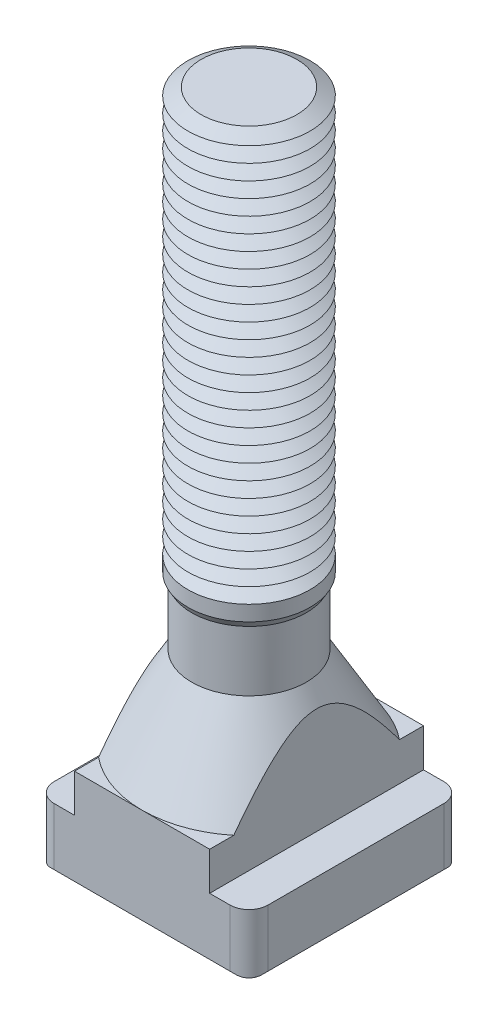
ISO-10303-21;
HEADER;
FILE_DESCRIPTION(('STEP AP214'),'2;1');
FILE_NAME('part.step','',(''),(''),'','','');
FILE_SCHEMA(('AUTOMOTIVE_DESIGN { 1 0 10303 214 1 1 1 1 }'));
ENDSEC;
DATA;
#1=APPLICATION_CONTEXT('core data for automotive mechanical design processes');
#2=APPLICATION_PROTOCOL_DEFINITION('international standard','automotive_design',2000,#1);
#3=PRODUCT_CONTEXT('',#1,'mechanical');
#4=PRODUCT('Part','Part','',(#3));
#5=PRODUCT_RELATED_PRODUCT_CATEGORY('part','',(#4));
#6=PRODUCT_DEFINITION_FORMATION('','',#4);
#7=PRODUCT_DEFINITION_CONTEXT('part definition',#1,'design');
#8=PRODUCT_DEFINITION('design','',#6,#7);
#9=PRODUCT_DEFINITION_SHAPE('','',#8);
#10=(LENGTH_UNIT() NAMED_UNIT(*) SI_UNIT(.MILLI.,.METRE.));
#11=(NAMED_UNIT(*) PLANE_ANGLE_UNIT() SI_UNIT($,.RADIAN.));
#12=(NAMED_UNIT(*) SI_UNIT($,.STERADIAN.) SOLID_ANGLE_UNIT());
#13=UNCERTAINTY_MEASURE_WITH_UNIT(LENGTH_MEASURE(1.E-05),#10,'distance_accuracy_value','');
#14=(GEOMETRIC_REPRESENTATION_CONTEXT(3) GLOBAL_UNCERTAINTY_ASSIGNED_CONTEXT((#13)) GLOBAL_UNIT_ASSIGNED_CONTEXT((#10,
#11,#12)) REPRESENTATION_CONTEXT('',''));
#15=CARTESIAN_POINT('',(0.,0.,0.));
#16=DIRECTION('',(0.,0.,1.));
#17=DIRECTION('',(1.,0.,0.));
#18=AXIS2_PLACEMENT_3D('',#15,#16,#17);
#19=CARTESIAN_POINT('',(0.,82.,0.));
#20=DIRECTION('',(0.,-1.,0.));
#21=DIRECTION('',(0.,0.,-1.));
#22=AXIS2_PLACEMENT_3D('',#19,#20,#21);
#23=CONICAL_SURFACE('',#22,6.26794919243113,1.0471975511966);
#24=CARTESIAN_POINT('',(0.,81.,0.));
#25=DIRECTION('',(0.,-1.,0.));
#26=DIRECTION('',(0.,0.,-1.));
#27=AXIS2_PLACEMENT_3D('',#24,#25,#26);
#28=CIRCLE('',#27,8.00000000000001);
#29=CARTESIAN_POINT('',(0.,81.,-8.00000000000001));
#30=VERTEX_POINT('',#29);
#31=EDGE_CURVE('E697',#30,#30,#28,.T.);
#32=ORIENTED_EDGE('',*,*,#31,.F.);
#33=EDGE_LOOP('',(#32));
#34=FACE_BOUND('',#33,.T.);
#35=CARTESIAN_POINT('',(0.,82.,0.));
#36=DIRECTION('',(0.,-1.,0.));
#37=DIRECTION('',(0.,0.,-1.));
#38=AXIS2_PLACEMENT_3D('',#35,#36,#37);
#39=CIRCLE('',#38,6.26794919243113);
#40=CARTESIAN_POINT('',(0.,82.,-6.26794919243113));
#41=VERTEX_POINT('',#40);
#42=EDGE_CURVE('E706',#41,#41,#39,.T.);
#43=ORIENTED_EDGE('',*,*,#42,.T.);
#44=EDGE_LOOP('',(#43));
#45=FACE_BOUND('',#44,.T.);
#46=ADVANCED_FACE('F39',(#34,#45),#23,.T.);
#47=CARTESIAN_POINT('',(0.,83.,0.));
#48=DIRECTION('',(0.,1.,0.));
#49=DIRECTION('',(0.,0.,1.));
#50=AXIS2_PLACEMENT_3D('',#47,#48,#49);
#51=CONICAL_SURFACE('',#50,8.00000000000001,1.0471975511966);
#52=ORIENTED_EDGE('',*,*,#42,.F.);
#53=EDGE_LOOP('',(#52));
#54=FACE_BOUND('',#53,.T.);
#55=CARTESIAN_POINT('',(0.,83.,0.));
#56=DIRECTION('',(0.,-1.,0.));
#57=DIRECTION('',(0.,0.,-1.));
#58=AXIS2_PLACEMENT_3D('',#55,#56,#57);
#59=CIRCLE('',#58,8.00000000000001);
#60=CARTESIAN_POINT('',(0.,83.,-8.00000000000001));
#61=VERTEX_POINT('',#60);
#62=EDGE_CURVE('E710',#61,#61,#59,.T.);
#63=ORIENTED_EDGE('',*,*,#62,.T.);
#64=EDGE_LOOP('',(#63));
#65=FACE_BOUND('',#64,.T.);
#66=ADVANCED_FACE('F448',(#54,#65),#51,.T.);
#67=CARTESIAN_POINT('',(3.72294312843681,90.,0.));
#68=DIRECTION('',(0.,-1.,0.));
#69=DIRECTION('',(1.,0.,0.));
#70=AXIS2_PLACEMENT_3D('',#67,#68,#69);
#71=PLANE('',#70);
#72=CARTESIAN_POINT('',(0.,90.,0.));
#73=DIRECTION('',(0.,-1.,0.));
#74=DIRECTION('',(0.,0.,-1.));
#75=AXIS2_PLACEMENT_3D('',#72,#73,#74);
#76=CIRCLE('',#75,6.26794919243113);
#77=CARTESIAN_POINT('',(0.,90.,-6.26794919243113));
#78=VERTEX_POINT('',#77);
#79=EDGE_CURVE('E737',#78,#78,#76,.T.);
#80=ORIENTED_EDGE('',*,*,#79,.F.);
#81=EDGE_LOOP('',(#80));
#82=FACE_BOUND('',#81,.T.);
#83=ADVANCED_FACE('F454',(#82),#71,.F.);
#84=CARTESIAN_POINT('',(0.,90.,0.));
#85=DIRECTION('',(0.,-1.,0.));
#86=DIRECTION('',(0.,0.,-1.));
#87=AXIS2_PLACEMENT_3D('',#84,#85,#86);
#88=CONICAL_SURFACE('',#87,6.26794919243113,1.0471975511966);
#89=CARTESIAN_POINT('',(0.,89.,0.));
#90=DIRECTION('',(0.,-1.,0.));
#91=DIRECTION('',(0.,0.,-1.));
#92=AXIS2_PLACEMENT_3D('',#89,#90,#91);
#93=CIRCLE('',#92,8.00000000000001);
#94=CARTESIAN_POINT('',(0.,89.,-8.00000000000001));
#95=VERTEX_POINT('',#94);
#96=EDGE_CURVE('E733',#95,#95,#93,.T.);
#97=ORIENTED_EDGE('',*,*,#96,.F.);
#98=EDGE_LOOP('',(#97));
#99=FACE_BOUND('',#98,.T.);
#100=ORIENTED_EDGE('',*,*,#79,.T.);
#101=EDGE_LOOP('',(#100));
#102=FACE_BOUND('',#101,.T.);
#103=ADVANCED_FACE('F482',(#99,#102),#88,.T.);
#104=CARTESIAN_POINT('',(0.,89.,0.));
#105=DIRECTION('',(0.,1.,0.));
#106=DIRECTION('',(0.,0.,1.));
#107=AXIS2_PLACEMENT_3D('',#104,#105,#106);
#108=CONICAL_SURFACE('',#107,8.00000000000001,1.0471975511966);
#109=CARTESIAN_POINT('',(0.,88.,0.));
#110=DIRECTION('',(0.,-1.,0.));
#111=DIRECTION('',(0.,0.,-1.));
#112=AXIS2_PLACEMENT_3D('',#109,#110,#111);
#113=CIRCLE('',#112,6.26794919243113);
#114=CARTESIAN_POINT('',(0.,88.,-6.26794919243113));
#115=VERTEX_POINT('',#114);
#116=EDGE_CURVE('E729',#115,#115,#113,.T.);
#117=ORIENTED_EDGE('',*,*,#116,.F.);
#118=EDGE_LOOP('',(#117));
#119=FACE_BOUND('',#118,.T.);
#120=ORIENTED_EDGE('',*,*,#96,.T.);
#121=EDGE_LOOP('',(#120));
#122=FACE_BOUND('',#121,.T.);
#123=ADVANCED_FACE('F479',(#119,#122),#108,.T.);
#124=CARTESIAN_POINT('',(0.,88.,0.));
#125=DIRECTION('',(0.,-1.,0.));
#126=DIRECTION('',(0.,0.,-1.));
#127=AXIS2_PLACEMENT_3D('',#124,#125,#126);
#128=CONICAL_SURFACE('',#127,6.26794919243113,1.0471975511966);
#129=CARTESIAN_POINT('',(0.,87.,0.));
#130=DIRECTION('',(0.,-1.,0.));
#131=DIRECTION('',(0.,0.,-1.));
#132=AXIS2_PLACEMENT_3D('',#129,#130,#131);
#133=CIRCLE('',#132,8.00000000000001);
#134=CARTESIAN_POINT('',(0.,87.,-8.00000000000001));
#135=VERTEX_POINT('',#134);
#136=EDGE_CURVE('E725',#135,#135,#133,.T.);
#137=ORIENTED_EDGE('',*,*,#136,.F.);
#138=EDGE_LOOP('',(#137));
#139=FACE_BOUND('',#138,.T.);
#140=ORIENTED_EDGE('',*,*,#116,.T.);
#141=EDGE_LOOP('',(#140));
#142=FACE_BOUND('',#141,.T.);
#143=ADVANCED_FACE('F474',(#139,#142),#128,.T.);
#144=CARTESIAN_POINT('',(0.,87.,0.));
#145=DIRECTION('',(0.,1.,0.));
#146=DIRECTION('',(0.,0.,1.));
#147=AXIS2_PLACEMENT_3D('',#144,#145,#146);
#148=CONICAL_SURFACE('',#147,8.00000000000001,1.0471975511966);
#149=CARTESIAN_POINT('',(0.,86.,0.));
#150=DIRECTION('',(0.,-1.,0.));
#151=DIRECTION('',(0.,0.,-1.));
#152=AXIS2_PLACEMENT_3D('',#149,#150,#151);
#153=CIRCLE('',#152,6.26794919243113);
#154=CARTESIAN_POINT('',(0.,86.,-6.26794919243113));
#155=VERTEX_POINT('',#154);
#156=EDGE_CURVE('E722',#155,#155,#153,.T.);
#157=ORIENTED_EDGE('',*,*,#156,.F.);
#158=EDGE_LOOP('',(#157));
#159=FACE_BOUND('',#158,.T.);
#160=ORIENTED_EDGE('',*,*,#136,.T.);
#161=EDGE_LOOP('',(#160));
#162=FACE_BOUND('',#161,.T.);
#163=ADVANCED_FACE('F471',(#159,#162),#148,.T.);
#164=CARTESIAN_POINT('',(0.,86.,0.));
#165=DIRECTION('',(0.,-1.,0.));
#166=DIRECTION('',(0.,0.,-1.));
#167=AXIS2_PLACEMENT_3D('',#164,#165,#166);
#168=CONICAL_SURFACE('',#167,6.26794919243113,1.0471975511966);
#169=CARTESIAN_POINT('',(0.,85.,0.));
#170=DIRECTION('',(0.,-1.,0.));
#171=DIRECTION('',(0.,0.,-1.));
#172=AXIS2_PLACEMENT_3D('',#169,#170,#171);
#173=CIRCLE('',#172,8.00000000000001);
#174=CARTESIAN_POINT('',(0.,85.,-8.00000000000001));
#175=VERTEX_POINT('',#174);
#176=EDGE_CURVE('E718',#175,#175,#173,.T.);
#177=ORIENTED_EDGE('',*,*,#176,.F.);
#178=EDGE_LOOP('',(#177));
#179=FACE_BOUND('',#178,.T.);
#180=ORIENTED_EDGE('',*,*,#156,.T.);
#181=EDGE_LOOP('',(#180));
#182=FACE_BOUND('',#181,.T.);
#183=ADVANCED_FACE('F465',(#179,#182),#168,.T.);
#184=CARTESIAN_POINT('',(0.,85.,0.));
#185=DIRECTION('',(0.,1.,0.));
#186=DIRECTION('',(0.,0.,1.));
#187=AXIS2_PLACEMENT_3D('',#184,#185,#186);
#188=CONICAL_SURFACE('',#187,8.00000000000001,1.0471975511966);
#189=CARTESIAN_POINT('',(0.,84.,0.));
#190=DIRECTION('',(0.,-1.,0.));
#191=DIRECTION('',(0.,0.,-1.));
#192=AXIS2_PLACEMENT_3D('',#189,#190,#191);
#193=CIRCLE('',#192,6.26794919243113);
#194=CARTESIAN_POINT('',(0.,84.,-6.26794919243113));
#195=VERTEX_POINT('',#194);
#196=EDGE_CURVE('E714',#195,#195,#193,.T.);
#197=ORIENTED_EDGE('',*,*,#196,.F.);
#198=EDGE_LOOP('',(#197));
#199=FACE_BOUND('',#198,.T.);
#200=ORIENTED_EDGE('',*,*,#176,.T.);
#201=EDGE_LOOP('',(#200));
#202=FACE_BOUND('',#201,.T.);
#203=ADVANCED_FACE('F461',(#199,#202),#188,.T.);
#204=CARTESIAN_POINT('',(0.,84.,0.));
#205=DIRECTION('',(0.,-1.,0.));
#206=DIRECTION('',(0.,0.,-1.));
#207=AXIS2_PLACEMENT_3D('',#204,#205,#206);
#208=CONICAL_SURFACE('',#207,6.26794919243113,1.0471975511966);
#209=ORIENTED_EDGE('',*,*,#62,.F.);
#210=EDGE_LOOP('',(#209));
#211=FACE_BOUND('',#210,.T.);
#212=ORIENTED_EDGE('',*,*,#196,.T.);
#213=EDGE_LOOP('',(#212));
#214=FACE_BOUND('',#213,.T.);
#215=ADVANCED_FACE('F464',(#211,#214),#208,.T.);
#216=CARTESIAN_POINT('',(0.,80.,0.));
#217=DIRECTION('',(0.,-1.,0.));
#218=DIRECTION('',(0.,0.,-1.));
#219=AXIS2_PLACEMENT_3D('',#216,#217,#218);
#220=CONICAL_SURFACE('',#219,6.26794919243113,1.0471975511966);
#221=CARTESIAN_POINT('',(0.,79.,0.));
#222=DIRECTION('',(0.,-1.,0.));
#223=DIRECTION('',(0.,0.,-1.));
#224=AXIS2_PLACEMENT_3D('',#221,#222,#223);
#225=CIRCLE('',#224,8.00000000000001);
#226=CARTESIAN_POINT('',(0.,79.,-8.00000000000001));
#227=VERTEX_POINT('',#226);
#228=EDGE_CURVE('E689',#227,#227,#225,.T.);
#229=ORIENTED_EDGE('',*,*,#228,.F.);
#230=EDGE_LOOP('',(#229));
#231=FACE_BOUND('',#230,.T.);
#232=CARTESIAN_POINT('',(0.,80.,0.));
#233=DIRECTION('',(0.,-1.,0.));
#234=DIRECTION('',(0.,0.,-1.));
#235=AXIS2_PLACEMENT_3D('',#232,#233,#234);
#236=CIRCLE('',#235,6.26794919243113);
#237=CARTESIAN_POINT('',(0.,80.,-6.26794919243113));
#238=VERTEX_POINT('',#237);
#239=EDGE_CURVE('E691',#238,#238,#236,.T.);
#240=ORIENTED_EDGE('',*,*,#239,.T.);
#241=EDGE_LOOP('',(#240));
#242=FACE_BOUND('',#241,.T.);
#243=ADVANCED_FACE('F469',(#231,#242),#220,.T.);
#244=CARTESIAN_POINT('',(0.,81.,0.));
#245=DIRECTION('',(0.,1.,0.));
#246=DIRECTION('',(0.,0.,1.));
#247=AXIS2_PLACEMENT_3D('',#244,#245,#246);
#248=CONICAL_SURFACE('',#247,8.00000000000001,1.0471975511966);
#249=ORIENTED_EDGE('',*,*,#239,.F.);
#250=EDGE_LOOP('',(#249));
#251=FACE_BOUND('',#250,.T.);
#252=ORIENTED_EDGE('',*,*,#31,.T.);
#253=EDGE_LOOP('',(#252));
#254=FACE_BOUND('',#253,.T.);
#255=ADVANCED_FACE('F1103',(#251,#254),#248,.T.);
#256=CARTESIAN_POINT('',(0.,78.,0.));
#257=DIRECTION('',(0.,-1.,0.));
#258=DIRECTION('',(0.,0.,-1.));
#259=AXIS2_PLACEMENT_3D('',#256,#257,#258);
#260=CONICAL_SURFACE('',#259,6.26794919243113,1.0471975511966);
#261=CARTESIAN_POINT('',(0.,77.,0.));
#262=DIRECTION('',(0.,-1.,0.));
#263=DIRECTION('',(0.,0.,-1.));
#264=AXIS2_PLACEMENT_3D('',#261,#262,#263);
#265=CIRCLE('',#264,8.00000000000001);
#266=CARTESIAN_POINT('',(0.,77.,-8.00000000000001));
#267=VERTEX_POINT('',#266);
#268=EDGE_CURVE('E651',#267,#267,#265,.T.);
#269=ORIENTED_EDGE('',*,*,#268,.F.);
#270=EDGE_LOOP('',(#269));
#271=FACE_BOUND('',#270,.T.);
#272=CARTESIAN_POINT('',(0.,78.,0.));
#273=DIRECTION('',(0.,-1.,0.));
#274=DIRECTION('',(0.,0.,-1.));
#275=AXIS2_PLACEMENT_3D('',#272,#273,#274);
#276=CIRCLE('',#275,6.26794919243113);
#277=CARTESIAN_POINT('',(0.,78.,-6.26794919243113));
#278=VERTEX_POINT('',#277);
#279=EDGE_CURVE('E654',#278,#278,#276,.T.);
#280=ORIENTED_EDGE('',*,*,#279,.T.);
#281=EDGE_LOOP('',(#280));
#282=FACE_BOUND('',#281,.T.);
#283=ADVANCED_FACE('F1097',(#271,#282),#260,.T.);
#284=CARTESIAN_POINT('',(0.,79.,0.));
#285=DIRECTION('',(0.,1.,0.));
#286=DIRECTION('',(0.,0.,1.));
#287=AXIS2_PLACEMENT_3D('',#284,#285,#286);
#288=CONICAL_SURFACE('',#287,8.00000000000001,1.0471975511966);
#289=ORIENTED_EDGE('',*,*,#279,.F.);
#290=EDGE_LOOP('',(#289));
#291=FACE_BOUND('',#290,.T.);
#292=ORIENTED_EDGE('',*,*,#228,.T.);
#293=EDGE_LOOP('',(#292));
#294=FACE_BOUND('',#293,.T.);
#295=ADVANCED_FACE('F1089',(#291,#294),#288,.T.);
#296=CARTESIAN_POINT('',(0.,76.,0.));
#297=DIRECTION('',(0.,-1.,0.));
#298=DIRECTION('',(0.,0.,-1.));
#299=AXIS2_PLACEMENT_3D('',#296,#297,#298);
#300=CONICAL_SURFACE('',#299,6.26794919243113,1.0471975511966);
#301=CARTESIAN_POINT('',(0.,75.,0.));
#302=DIRECTION('',(0.,-1.,0.));
#303=DIRECTION('',(0.,0.,-1.));
#304=AXIS2_PLACEMENT_3D('',#301,#302,#303);
#305=CIRCLE('',#304,8.00000000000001);
#306=CARTESIAN_POINT('',(0.,75.,-8.00000000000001));
#307=VERTEX_POINT('',#306);
#308=EDGE_CURVE('E779',#307,#307,#305,.T.);
#309=ORIENTED_EDGE('',*,*,#308,.F.);
#310=EDGE_LOOP('',(#309));
#311=FACE_BOUND('',#310,.T.);
#312=CARTESIAN_POINT('',(0.,76.,0.));
#313=DIRECTION('',(0.,-1.,0.));
#314=DIRECTION('',(0.,0.,-1.));
#315=AXIS2_PLACEMENT_3D('',#312,#313,#314);
#316=CIRCLE('',#315,6.26794919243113);
#317=CARTESIAN_POINT('',(0.,76.,-6.26794919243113));
#318=VERTEX_POINT('',#317);
#319=EDGE_CURVE('E655',#318,#318,#316,.T.);
#320=ORIENTED_EDGE('',*,*,#319,.T.);
#321=EDGE_LOOP('',(#320));
#322=FACE_BOUND('',#321,.T.);
#323=ADVANCED_FACE('F1087',(#311,#322),#300,.T.);
#324=CARTESIAN_POINT('',(0.,77.,0.));
#325=DIRECTION('',(0.,1.,0.));
#326=DIRECTION('',(0.,0.,1.));
#327=AXIS2_PLACEMENT_3D('',#324,#325,#326);
#328=CONICAL_SURFACE('',#327,8.00000000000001,1.0471975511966);
#329=ORIENTED_EDGE('',*,*,#319,.F.);
#330=EDGE_LOOP('',(#329));
#331=FACE_BOUND('',#330,.T.);
#332=ORIENTED_EDGE('',*,*,#268,.T.);
#333=EDGE_LOOP('',(#332));
#334=FACE_BOUND('',#333,.T.);
#335=ADVANCED_FACE('F1078',(#331,#334),#328,.T.);
#336=CARTESIAN_POINT('',(0.,74.,0.));
#337=DIRECTION('',(0.,-1.,0.));
#338=DIRECTION('',(0.,0.,-1.));
#339=AXIS2_PLACEMENT_3D('',#336,#337,#338);
#340=CONICAL_SURFACE('',#339,6.26794919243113,1.0471975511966);
#341=CARTESIAN_POINT('',(0.,73.,0.));
#342=DIRECTION('',(0.,-1.,0.));
#343=DIRECTION('',(0.,0.,-1.));
#344=AXIS2_PLACEMENT_3D('',#341,#342,#343);
#345=CIRCLE('',#344,8.00000000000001);
#346=CARTESIAN_POINT('',(0.,73.,-8.00000000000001));
#347=VERTEX_POINT('',#346);
#348=EDGE_CURVE('E672',#347,#347,#345,.T.);
#349=ORIENTED_EDGE('',*,*,#348,.F.);
#350=EDGE_LOOP('',(#349));
#351=FACE_BOUND('',#350,.T.);
#352=CARTESIAN_POINT('',(0.,74.,0.));
#353=DIRECTION('',(0.,-1.,0.));
#354=DIRECTION('',(0.,0.,-1.));
#355=AXIS2_PLACEMENT_3D('',#352,#353,#354);
#356=CIRCLE('',#355,6.26794919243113);
#357=CARTESIAN_POINT('',(0.,74.,-6.26794919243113));
#358=VERTEX_POINT('',#357);
#359=EDGE_CURVE('E676',#358,#358,#356,.T.);
#360=ORIENTED_EDGE('',*,*,#359,.T.);
#361=EDGE_LOOP('',(#360));
#362=FACE_BOUND('',#361,.T.);
#363=ADVANCED_FACE('F1075',(#351,#362),#340,.T.);
#364=CARTESIAN_POINT('',(0.,75.,0.));
#365=DIRECTION('',(0.,1.,0.));
#366=DIRECTION('',(0.,0.,1.));
#367=AXIS2_PLACEMENT_3D('',#364,#365,#366);
#368=CONICAL_SURFACE('',#367,8.00000000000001,1.0471975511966);
#369=ORIENTED_EDGE('',*,*,#359,.F.);
#370=EDGE_LOOP('',(#369));
#371=FACE_BOUND('',#370,.T.);
#372=ORIENTED_EDGE('',*,*,#308,.T.);
#373=EDGE_LOOP('',(#372));
#374=FACE_BOUND('',#373,.T.);
#375=ADVANCED_FACE('F1066',(#371,#374),#368,.T.);
#376=CARTESIAN_POINT('',(0.,72.,0.));
#377=DIRECTION('',(0.,-1.,0.));
#378=DIRECTION('',(0.,0.,-1.));
#379=AXIS2_PLACEMENT_3D('',#376,#377,#378);
#380=CONICAL_SURFACE('',#379,6.26794919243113,1.0471975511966);
#381=CARTESIAN_POINT('',(0.,71.,0.));
#382=DIRECTION('',(0.,-1.,0.));
#383=DIRECTION('',(0.,0.,-1.));
#384=AXIS2_PLACEMENT_3D('',#381,#382,#383);
#385=CIRCLE('',#384,8.00000000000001);
#386=CARTESIAN_POINT('',(0.,71.,-8.00000000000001));
#387=VERTEX_POINT('',#386);
#388=EDGE_CURVE('E673',#387,#387,#385,.T.);
#389=ORIENTED_EDGE('',*,*,#388,.F.);
#390=EDGE_LOOP('',(#389));
#391=FACE_BOUND('',#390,.T.);
#392=CARTESIAN_POINT('',(0.,72.,0.));
#393=DIRECTION('',(0.,-1.,0.));
#394=DIRECTION('',(0.,0.,-1.));
#395=AXIS2_PLACEMENT_3D('',#392,#393,#394);
#396=CIRCLE('',#395,6.26794919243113);
#397=CARTESIAN_POINT('',(0.,72.,-6.26794919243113));
#398=VERTEX_POINT('',#397);
#399=EDGE_CURVE('E669',#398,#398,#396,.T.);
#400=ORIENTED_EDGE('',*,*,#399,.T.);
#401=EDGE_LOOP('',(#400));
#402=FACE_BOUND('',#401,.T.);
#403=ADVANCED_FACE('F1063',(#391,#402),#380,.T.);
#404=CARTESIAN_POINT('',(0.,73.,0.));
#405=DIRECTION('',(0.,1.,0.));
#406=DIRECTION('',(0.,0.,1.));
#407=AXIS2_PLACEMENT_3D('',#404,#405,#406);
#408=CONICAL_SURFACE('',#407,8.00000000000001,1.0471975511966);
#409=ORIENTED_EDGE('',*,*,#399,.F.);
#410=EDGE_LOOP('',(#409));
#411=FACE_BOUND('',#410,.T.);
#412=ORIENTED_EDGE('',*,*,#348,.T.);
#413=EDGE_LOOP('',(#412));
#414=FACE_BOUND('',#413,.T.);
#415=ADVANCED_FACE('F1054',(#411,#414),#408,.T.);
#416=CARTESIAN_POINT('',(0.,70.,0.));
#417=DIRECTION('',(0.,-1.,0.));
#418=DIRECTION('',(0.,0.,-1.));
#419=AXIS2_PLACEMENT_3D('',#416,#417,#418);
#420=CONICAL_SURFACE('',#419,6.26794919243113,1.0471975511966);
#421=CARTESIAN_POINT('',(0.,69.,0.));
#422=DIRECTION('',(0.,-1.,0.));
#423=DIRECTION('',(0.,0.,-1.));
#424=AXIS2_PLACEMENT_3D('',#421,#422,#423);
#425=CIRCLE('',#424,8.00000000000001);
#426=CARTESIAN_POINT('',(0.,69.,-8.00000000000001));
#427=VERTEX_POINT('',#426);
#428=EDGE_CURVE('E777',#427,#427,#425,.T.);
#429=ORIENTED_EDGE('',*,*,#428,.F.);
#430=EDGE_LOOP('',(#429));
#431=FACE_BOUND('',#430,.T.);
#432=CARTESIAN_POINT('',(0.,70.,0.));
#433=DIRECTION('',(0.,-1.,0.));
#434=DIRECTION('',(0.,0.,-1.));
#435=AXIS2_PLACEMENT_3D('',#432,#433,#434);
#436=CIRCLE('',#435,6.26794919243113);
#437=CARTESIAN_POINT('',(0.,70.,-6.26794919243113));
#438=VERTEX_POINT('',#437);
#439=EDGE_CURVE('E794',#438,#438,#436,.T.);
#440=ORIENTED_EDGE('',*,*,#439,.T.);
#441=EDGE_LOOP('',(#440));
#442=FACE_BOUND('',#441,.T.);
#443=ADVANCED_FACE('F1051',(#431,#442),#420,.T.);
#444=CARTESIAN_POINT('',(0.,71.,0.));
#445=DIRECTION('',(0.,1.,0.));
#446=DIRECTION('',(0.,0.,1.));
#447=AXIS2_PLACEMENT_3D('',#444,#445,#446);
#448=CONICAL_SURFACE('',#447,8.00000000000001,1.0471975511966);
#449=ORIENTED_EDGE('',*,*,#439,.F.);
#450=EDGE_LOOP('',(#449));
#451=FACE_BOUND('',#450,.T.);
#452=ORIENTED_EDGE('',*,*,#388,.T.);
#453=EDGE_LOOP('',(#452));
#454=FACE_BOUND('',#453,.T.);
#455=ADVANCED_FACE('F1042',(#451,#454),#448,.T.);
#456=CARTESIAN_POINT('',(0.,68.,0.));
#457=DIRECTION('',(0.,-1.,0.));
#458=DIRECTION('',(0.,0.,-1.));
#459=AXIS2_PLACEMENT_3D('',#456,#457,#458);
#460=CONICAL_SURFACE('',#459,6.26794919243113,1.0471975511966);
#461=CARTESIAN_POINT('',(0.,67.,0.));
#462=DIRECTION('',(0.,-1.,0.));
#463=DIRECTION('',(0.,0.,-1.));
#464=AXIS2_PLACEMENT_3D('',#461,#462,#463);
#465=CIRCLE('',#464,8.00000000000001);
#466=CARTESIAN_POINT('',(0.,67.,-8.00000000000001));
#467=VERTEX_POINT('',#466);
#468=EDGE_CURVE('E648',#467,#467,#465,.T.);
#469=ORIENTED_EDGE('',*,*,#468,.F.);
#470=EDGE_LOOP('',(#469));
#471=FACE_BOUND('',#470,.T.);
#472=CARTESIAN_POINT('',(0.,68.,0.));
#473=DIRECTION('',(0.,-1.,0.));
#474=DIRECTION('',(0.,0.,-1.));
#475=AXIS2_PLACEMENT_3D('',#472,#473,#474);
#476=CIRCLE('',#475,6.26794919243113);
#477=CARTESIAN_POINT('',(0.,68.,-6.26794919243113));
#478=VERTEX_POINT('',#477);
#479=EDGE_CURVE('E774',#478,#478,#476,.T.);
#480=ORIENTED_EDGE('',*,*,#479,.T.);
#481=EDGE_LOOP('',(#480));
#482=FACE_BOUND('',#481,.T.);
#483=ADVANCED_FACE('F1039',(#471,#482),#460,.T.);
#484=CARTESIAN_POINT('',(0.,69.,0.));
#485=DIRECTION('',(0.,1.,0.));
#486=DIRECTION('',(0.,0.,1.));
#487=AXIS2_PLACEMENT_3D('',#484,#485,#486);
#488=CONICAL_SURFACE('',#487,8.00000000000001,1.0471975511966);
#489=ORIENTED_EDGE('',*,*,#479,.F.);
#490=EDGE_LOOP('',(#489));
#491=FACE_BOUND('',#490,.T.);
#492=ORIENTED_EDGE('',*,*,#428,.T.);
#493=EDGE_LOOP('',(#492));
#494=FACE_BOUND('',#493,.T.);
#495=ADVANCED_FACE('F1030',(#491,#494),#488,.T.);
#496=CARTESIAN_POINT('',(0.,66.,0.));
#497=DIRECTION('',(0.,-1.,0.));
#498=DIRECTION('',(0.,0.,-1.));
#499=AXIS2_PLACEMENT_3D('',#496,#497,#498);
#500=CONICAL_SURFACE('',#499,6.26794919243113,1.0471975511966);
#501=CARTESIAN_POINT('',(0.,65.,0.));
#502=DIRECTION('',(0.,-1.,0.));
#503=DIRECTION('',(0.,0.,-1.));
#504=AXIS2_PLACEMENT_3D('',#501,#502,#503);
#505=CIRCLE('',#504,8.00000000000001);
#506=CARTESIAN_POINT('',(0.,65.,-8.00000000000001));
#507=VERTEX_POINT('',#506);
#508=EDGE_CURVE('E649',#507,#507,#505,.T.);
#509=ORIENTED_EDGE('',*,*,#508,.F.);
#510=EDGE_LOOP('',(#509));
#511=FACE_BOUND('',#510,.T.);
#512=CARTESIAN_POINT('',(0.,66.,0.));
#513=DIRECTION('',(0.,-1.,0.));
#514=DIRECTION('',(0.,0.,-1.));
#515=AXIS2_PLACEMENT_3D('',#512,#513,#514);
#516=CIRCLE('',#515,6.26794919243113);
#517=CARTESIAN_POINT('',(0.,66.,-6.26794919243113));
#518=VERTEX_POINT('',#517);
#519=EDGE_CURVE('E645',#518,#518,#516,.T.);
#520=ORIENTED_EDGE('',*,*,#519,.T.);
#521=EDGE_LOOP('',(#520));
#522=FACE_BOUND('',#521,.T.);
#523=ADVANCED_FACE('F1027',(#511,#522),#500,.T.);
#524=CARTESIAN_POINT('',(0.,67.,0.));
#525=DIRECTION('',(0.,1.,0.));
#526=DIRECTION('',(0.,0.,1.));
#527=AXIS2_PLACEMENT_3D('',#524,#525,#526);
#528=CONICAL_SURFACE('',#527,8.00000000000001,1.0471975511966);
#529=ORIENTED_EDGE('',*,*,#519,.F.);
#530=EDGE_LOOP('',(#529));
#531=FACE_BOUND('',#530,.T.);
#532=ORIENTED_EDGE('',*,*,#468,.T.);
#533=EDGE_LOOP('',(#532));
#534=FACE_BOUND('',#533,.T.);
#535=ADVANCED_FACE('F1018',(#531,#534),#528,.T.);
#536=CARTESIAN_POINT('',(0.,64.,0.));
#537=DIRECTION('',(0.,-1.,0.));
#538=DIRECTION('',(0.,0.,-1.));
#539=AXIS2_PLACEMENT_3D('',#536,#537,#538);
#540=CONICAL_SURFACE('',#539,6.26794919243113,1.0471975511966);
#541=CARTESIAN_POINT('',(0.,63.,0.));
#542=DIRECTION('',(0.,-1.,0.));
#543=DIRECTION('',(0.,0.,-1.));
#544=AXIS2_PLACEMENT_3D('',#541,#542,#543);
#545=CIRCLE('',#544,8.00000000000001);
#546=CARTESIAN_POINT('',(0.,63.,-8.00000000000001));
#547=VERTEX_POINT('',#546);
#548=EDGE_CURVE('E639',#547,#547,#545,.T.);
#549=ORIENTED_EDGE('',*,*,#548,.F.);
#550=EDGE_LOOP('',(#549));
#551=FACE_BOUND('',#550,.T.);
#552=CARTESIAN_POINT('',(0.,64.,0.));
#553=DIRECTION('',(0.,-1.,0.));
#554=DIRECTION('',(0.,0.,-1.));
#555=AXIS2_PLACEMENT_3D('',#552,#553,#554);
#556=CIRCLE('',#555,6.26794919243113);
#557=CARTESIAN_POINT('',(0.,64.,-6.26794919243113));
#558=VERTEX_POINT('',#557);
#559=EDGE_CURVE('E642',#558,#558,#556,.T.);
#560=ORIENTED_EDGE('',*,*,#559,.T.);
#561=EDGE_LOOP('',(#560));
#562=FACE_BOUND('',#561,.T.);
#563=ADVANCED_FACE('F1015',(#551,#562),#540,.T.);
#564=CARTESIAN_POINT('',(0.,65.,0.));
#565=DIRECTION('',(0.,1.,0.));
#566=DIRECTION('',(0.,0.,1.));
#567=AXIS2_PLACEMENT_3D('',#564,#565,#566);
#568=CONICAL_SURFACE('',#567,8.00000000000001,1.0471975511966);
#569=ORIENTED_EDGE('',*,*,#559,.F.);
#570=EDGE_LOOP('',(#569));
#571=FACE_BOUND('',#570,.T.);
#572=ORIENTED_EDGE('',*,*,#508,.T.);
#573=EDGE_LOOP('',(#572));
#574=FACE_BOUND('',#573,.T.);
#575=ADVANCED_FACE('F1006',(#571,#574),#568,.T.);
#576=CARTESIAN_POINT('',(0.,62.,0.));
#577=DIRECTION('',(0.,-1.,0.));
#578=DIRECTION('',(0.,0.,-1.));
#579=AXIS2_PLACEMENT_3D('',#576,#577,#578);
#580=CONICAL_SURFACE('',#579,6.26794919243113,1.0471975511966);
#581=CARTESIAN_POINT('',(0.,61.,0.));
#582=DIRECTION('',(0.,-1.,0.));
#583=DIRECTION('',(0.,0.,-1.));
#584=AXIS2_PLACEMENT_3D('',#581,#582,#583);
#585=CIRCLE('',#584,8.00000000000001);
#586=CARTESIAN_POINT('',(0.,61.,-8.00000000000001));
#587=VERTEX_POINT('',#586);
#588=EDGE_CURVE('E759',#587,#587,#585,.T.);
#589=ORIENTED_EDGE('',*,*,#588,.F.);
#590=EDGE_LOOP('',(#589));
#591=FACE_BOUND('',#590,.T.);
#592=CARTESIAN_POINT('',(0.,62.,0.));
#593=DIRECTION('',(0.,-1.,0.));
#594=DIRECTION('',(0.,0.,-1.));
#595=AXIS2_PLACEMENT_3D('',#592,#593,#594);
#596=CIRCLE('',#595,6.26794919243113);
#597=CARTESIAN_POINT('',(0.,62.,-6.26794919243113));
#598=VERTEX_POINT('',#597);
#599=EDGE_CURVE('E643',#598,#598,#596,.T.);
#600=ORIENTED_EDGE('',*,*,#599,.T.);
#601=EDGE_LOOP('',(#600));
#602=FACE_BOUND('',#601,.T.);
#603=ADVANCED_FACE('F1003',(#591,#602),#580,.T.);
#604=CARTESIAN_POINT('',(0.,63.,0.));
#605=DIRECTION('',(0.,1.,0.));
#606=DIRECTION('',(0.,0.,1.));
#607=AXIS2_PLACEMENT_3D('',#604,#605,#606);
#608=CONICAL_SURFACE('',#607,8.00000000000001,1.0471975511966);
#609=ORIENTED_EDGE('',*,*,#599,.F.);
#610=EDGE_LOOP('',(#609));
#611=FACE_BOUND('',#610,.T.);
#612=ORIENTED_EDGE('',*,*,#548,.T.);
#613=EDGE_LOOP('',(#612));
#614=FACE_BOUND('',#613,.T.);
#615=ADVANCED_FACE('F994',(#611,#614),#608,.T.);
#616=CARTESIAN_POINT('',(0.,60.,0.));
#617=DIRECTION('',(0.,-1.,0.));
#618=DIRECTION('',(0.,0.,-1.));
#619=AXIS2_PLACEMENT_3D('',#616,#617,#618);
#620=CONICAL_SURFACE('',#619,6.26794919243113,1.0471975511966);
#621=CARTESIAN_POINT('',(0.,59.,0.));
#622=DIRECTION('',(0.,-1.,0.));
#623=DIRECTION('',(0.,0.,-1.));
#624=AXIS2_PLACEMENT_3D('',#621,#622,#623);
#625=CIRCLE('',#624,8.00000000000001);
#626=CARTESIAN_POINT('',(0.,59.,-8.00000000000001));
#627=VERTEX_POINT('',#626);
#628=EDGE_CURVE('E664',#627,#627,#625,.T.);
#629=ORIENTED_EDGE('',*,*,#628,.F.);
#630=EDGE_LOOP('',(#629));
#631=FACE_BOUND('',#630,.T.);
#632=CARTESIAN_POINT('',(0.,60.,0.));
#633=DIRECTION('',(0.,-1.,0.));
#634=DIRECTION('',(0.,0.,-1.));
#635=AXIS2_PLACEMENT_3D('',#632,#633,#634);
#636=CIRCLE('',#635,6.26794919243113);
#637=CARTESIAN_POINT('',(0.,60.,-6.26794919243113));
#638=VERTEX_POINT('',#637);
#639=EDGE_CURVE('E687',#638,#638,#636,.T.);
#640=ORIENTED_EDGE('',*,*,#639,.T.);
#641=EDGE_LOOP('',(#640));
#642=FACE_BOUND('',#641,.T.);
#643=ADVANCED_FACE('F991',(#631,#642),#620,.T.);
#644=CARTESIAN_POINT('',(0.,61.,0.));
#645=DIRECTION('',(0.,1.,0.));
#646=DIRECTION('',(0.,0.,1.));
#647=AXIS2_PLACEMENT_3D('',#644,#645,#646);
#648=CONICAL_SURFACE('',#647,8.00000000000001,1.0471975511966);
#649=ORIENTED_EDGE('',*,*,#639,.F.);
#650=EDGE_LOOP('',(#649));
#651=FACE_BOUND('',#650,.T.);
#652=ORIENTED_EDGE('',*,*,#588,.T.);
#653=EDGE_LOOP('',(#652));
#654=FACE_BOUND('',#653,.T.);
#655=ADVANCED_FACE('F982',(#651,#654),#648,.T.);
#656=CARTESIAN_POINT('',(0.,58.,0.));
#657=DIRECTION('',(0.,-1.,0.));
#658=DIRECTION('',(0.,0.,-1.));
#659=AXIS2_PLACEMENT_3D('',#656,#657,#658);
#660=CONICAL_SURFACE('',#659,6.26794919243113,1.0471975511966);
#661=CARTESIAN_POINT('',(0.,57.,0.));
#662=DIRECTION('',(0.,-1.,0.));
#663=DIRECTION('',(0.,0.,-1.));
#664=AXIS2_PLACEMENT_3D('',#661,#662,#663);
#665=CIRCLE('',#664,8.00000000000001);
#666=CARTESIAN_POINT('',(0.,57.,-8.00000000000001));
#667=VERTEX_POINT('',#666);
#668=EDGE_CURVE('E633',#667,#667,#665,.T.);
#669=ORIENTED_EDGE('',*,*,#668,.F.);
#670=EDGE_LOOP('',(#669));
#671=FACE_BOUND('',#670,.T.);
#672=CARTESIAN_POINT('',(0.,58.,0.));
#673=DIRECTION('',(0.,-1.,0.));
#674=DIRECTION('',(0.,0.,-1.));
#675=AXIS2_PLACEMENT_3D('',#672,#673,#674);
#676=CIRCLE('',#675,6.26794919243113);
#677=CARTESIAN_POINT('',(0.,58.,-6.26794919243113));
#678=VERTEX_POINT('',#677);
#679=EDGE_CURVE('E636',#678,#678,#676,.T.);
#680=ORIENTED_EDGE('',*,*,#679,.T.);
#681=EDGE_LOOP('',(#680));
#682=FACE_BOUND('',#681,.T.);
#683=ADVANCED_FACE('F979',(#671,#682),#660,.T.);
#684=CARTESIAN_POINT('',(0.,59.,0.));
#685=DIRECTION('',(0.,1.,0.));
#686=DIRECTION('',(0.,0.,1.));
#687=AXIS2_PLACEMENT_3D('',#684,#685,#686);
#688=CONICAL_SURFACE('',#687,8.00000000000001,1.0471975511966);
#689=ORIENTED_EDGE('',*,*,#679,.F.);
#690=EDGE_LOOP('',(#689));
#691=FACE_BOUND('',#690,.T.);
#692=ORIENTED_EDGE('',*,*,#628,.T.);
#693=EDGE_LOOP('',(#692));
#694=FACE_BOUND('',#693,.T.);
#695=ADVANCED_FACE('F970',(#691,#694),#688,.T.);
#696=CARTESIAN_POINT('',(0.,56.,0.));
#697=DIRECTION('',(0.,-1.,0.));
#698=DIRECTION('',(0.,0.,-1.));
#699=AXIS2_PLACEMENT_3D('',#696,#697,#698);
#700=CONICAL_SURFACE('',#699,6.26794919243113,1.0471975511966);
#701=CARTESIAN_POINT('',(0.,55.,0.));
#702=DIRECTION('',(0.,-1.,0.));
#703=DIRECTION('',(0.,0.,-1.));
#704=AXIS2_PLACEMENT_3D('',#701,#702,#703);
#705=CIRCLE('',#704,8.00000000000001);
#706=CARTESIAN_POINT('',(0.,55.,-8.00000000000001));
#707=VERTEX_POINT('',#706);
#708=EDGE_CURVE('E764',#707,#707,#705,.T.);
#709=ORIENTED_EDGE('',*,*,#708,.F.);
#710=EDGE_LOOP('',(#709));
#711=FACE_BOUND('',#710,.T.);
#712=CARTESIAN_POINT('',(0.,56.,0.));
#713=DIRECTION('',(0.,-1.,0.));
#714=DIRECTION('',(0.,0.,-1.));
#715=AXIS2_PLACEMENT_3D('',#712,#713,#714);
#716=CIRCLE('',#715,6.26794919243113);
#717=CARTESIAN_POINT('',(0.,56.,-6.26794919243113));
#718=VERTEX_POINT('',#717);
#719=EDGE_CURVE('E637',#718,#718,#716,.T.);
#720=ORIENTED_EDGE('',*,*,#719,.T.);
#721=EDGE_LOOP('',(#720));
#722=FACE_BOUND('',#721,.T.);
#723=ADVANCED_FACE('F967',(#711,#722),#700,.T.);
#724=CARTESIAN_POINT('',(0.,57.,0.));
#725=DIRECTION('',(0.,1.,0.));
#726=DIRECTION('',(0.,0.,1.));
#727=AXIS2_PLACEMENT_3D('',#724,#725,#726);
#728=CONICAL_SURFACE('',#727,8.00000000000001,1.0471975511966);
#729=ORIENTED_EDGE('',*,*,#719,.F.);
#730=EDGE_LOOP('',(#729));
#731=FACE_BOUND('',#730,.T.);
#732=ORIENTED_EDGE('',*,*,#668,.T.);
#733=EDGE_LOOP('',(#732));
#734=FACE_BOUND('',#733,.T.);
#735=ADVANCED_FACE('F958',(#731,#734),#728,.T.);
#736=CARTESIAN_POINT('',(0.,54.,0.));
#737=DIRECTION('',(0.,-1.,0.));
#738=DIRECTION('',(0.,0.,-1.));
#739=AXIS2_PLACEMENT_3D('',#736,#737,#738);
#740=CONICAL_SURFACE('',#739,6.26794919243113,1.0471975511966);
#741=CARTESIAN_POINT('',(0.,53.,0.));
#742=DIRECTION('',(0.,-1.,0.));
#743=DIRECTION('',(0.,0.,-1.));
#744=AXIS2_PLACEMENT_3D('',#741,#742,#743);
#745=CIRCLE('',#744,8.00000000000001);
#746=CARTESIAN_POINT('',(0.,53.,-8.00000000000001));
#747=VERTEX_POINT('',#746);
#748=EDGE_CURVE('E832',#747,#747,#745,.T.);
#749=ORIENTED_EDGE('',*,*,#748,.F.);
#750=EDGE_LOOP('',(#749));
#751=FACE_BOUND('',#750,.T.);
#752=CARTESIAN_POINT('',(0.,54.,0.));
#753=DIRECTION('',(0.,-1.,0.));
#754=DIRECTION('',(0.,0.,-1.));
#755=AXIS2_PLACEMENT_3D('',#752,#753,#754);
#756=CIRCLE('',#755,6.26794919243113);
#757=CARTESIAN_POINT('',(0.,54.,-6.26794919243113));
#758=VERTEX_POINT('',#757);
#759=EDGE_CURVE('E828',#758,#758,#756,.T.);
#760=ORIENTED_EDGE('',*,*,#759,.T.);
#761=EDGE_LOOP('',(#760));
#762=FACE_BOUND('',#761,.T.);
#763=ADVANCED_FACE('F955',(#751,#762),#740,.T.);
#764=CARTESIAN_POINT('',(0.,55.,0.));
#765=DIRECTION('',(0.,1.,0.));
#766=DIRECTION('',(0.,0.,1.));
#767=AXIS2_PLACEMENT_3D('',#764,#765,#766);
#768=CONICAL_SURFACE('',#767,8.00000000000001,1.0471975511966);
#769=ORIENTED_EDGE('',*,*,#759,.F.);
#770=EDGE_LOOP('',(#769));
#771=FACE_BOUND('',#770,.T.);
#772=ORIENTED_EDGE('',*,*,#708,.T.);
#773=EDGE_LOOP('',(#772));
#774=FACE_BOUND('',#773,.T.);
#775=ADVANCED_FACE('F946',(#771,#774),#768,.T.);
#776=CARTESIAN_POINT('',(0.,52.,0.));
#777=DIRECTION('',(0.,-1.,0.));
#778=DIRECTION('',(0.,0.,-1.));
#779=AXIS2_PLACEMENT_3D('',#776,#777,#778);
#780=CONICAL_SURFACE('',#779,6.26794919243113,1.0471975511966);
#781=CARTESIAN_POINT('',(0.,51.,0.));
#782=DIRECTION('',(0.,-1.,0.));
#783=DIRECTION('',(0.,0.,-1.));
#784=AXIS2_PLACEMENT_3D('',#781,#782,#783);
#785=CIRCLE('',#784,8.00000000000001);
#786=CARTESIAN_POINT('',(0.,51.,-8.00000000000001));
#787=VERTEX_POINT('',#786);
#788=EDGE_CURVE('E789',#787,#787,#785,.T.);
#789=ORIENTED_EDGE('',*,*,#788,.F.);
#790=EDGE_LOOP('',(#789));
#791=FACE_BOUND('',#790,.T.);
#792=CARTESIAN_POINT('',(0.,52.,0.));
#793=DIRECTION('',(0.,-1.,0.));
#794=DIRECTION('',(0.,0.,-1.));
#795=AXIS2_PLACEMENT_3D('',#792,#793,#794);
#796=CIRCLE('',#795,6.26794919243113);
#797=CARTESIAN_POINT('',(0.,52.,-6.26794919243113));
#798=VERTEX_POINT('',#797);
#799=EDGE_CURVE('E792',#798,#798,#796,.T.);
#800=ORIENTED_EDGE('',*,*,#799,.T.);
#801=EDGE_LOOP('',(#800));
#802=FACE_BOUND('',#801,.T.);
#803=ADVANCED_FACE('F943',(#791,#802),#780,.T.);
#804=CARTESIAN_POINT('',(0.,53.,0.));
#805=DIRECTION('',(0.,1.,0.));
#806=DIRECTION('',(0.,0.,1.));
#807=AXIS2_PLACEMENT_3D('',#804,#805,#806);
#808=CONICAL_SURFACE('',#807,8.00000000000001,1.0471975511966);
#809=ORIENTED_EDGE('',*,*,#799,.F.);
#810=EDGE_LOOP('',(#809));
#811=FACE_BOUND('',#810,.T.);
#812=ORIENTED_EDGE('',*,*,#748,.T.);
#813=EDGE_LOOP('',(#812));
#814=FACE_BOUND('',#813,.T.);
#815=ADVANCED_FACE('F934',(#811,#814),#808,.T.);
#816=CARTESIAN_POINT('',(0.,50.,0.));
#817=DIRECTION('',(0.,-1.,0.));
#818=DIRECTION('',(0.,0.,-1.));
#819=AXIS2_PLACEMENT_3D('',#816,#817,#818);
#820=CONICAL_SURFACE('',#819,6.26794919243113,1.0471975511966);
#821=CARTESIAN_POINT('',(0.,49.,0.));
#822=DIRECTION('',(0.,-1.,0.));
#823=DIRECTION('',(0.,0.,-1.));
#824=AXIS2_PLACEMENT_3D('',#821,#822,#823);
#825=CIRCLE('',#824,8.00000000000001);
#826=CARTESIAN_POINT('',(0.,49.,-8.00000000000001));
#827=VERTEX_POINT('',#826);
#828=EDGE_CURVE('E752',#827,#827,#825,.T.);
#829=ORIENTED_EDGE('',*,*,#828,.F.);
#830=EDGE_LOOP('',(#829));
#831=FACE_BOUND('',#830,.T.);
#832=CARTESIAN_POINT('',(0.,50.,0.));
#833=DIRECTION('',(0.,-1.,0.));
#834=DIRECTION('',(0.,0.,-1.));
#835=AXIS2_PLACEMENT_3D('',#832,#833,#834);
#836=CIRCLE('',#835,6.26794919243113);
#837=CARTESIAN_POINT('',(0.,50.,-6.26794919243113));
#838=VERTEX_POINT('',#837);
#839=EDGE_CURVE('E787',#838,#838,#836,.T.);
#840=ORIENTED_EDGE('',*,*,#839,.T.);
#841=EDGE_LOOP('',(#840));
#842=FACE_BOUND('',#841,.T.);
#843=ADVANCED_FACE('F931',(#831,#842),#820,.T.);
#844=CARTESIAN_POINT('',(0.,51.,0.));
#845=DIRECTION('',(0.,1.,0.));
#846=DIRECTION('',(0.,0.,1.));
#847=AXIS2_PLACEMENT_3D('',#844,#845,#846);
#848=CONICAL_SURFACE('',#847,8.00000000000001,1.0471975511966);
#849=ORIENTED_EDGE('',*,*,#839,.F.);
#850=EDGE_LOOP('',(#849));
#851=FACE_BOUND('',#850,.T.);
#852=ORIENTED_EDGE('',*,*,#788,.T.);
#853=EDGE_LOOP('',(#852));
#854=FACE_BOUND('',#853,.T.);
#855=ADVANCED_FACE('F922',(#851,#854),#848,.T.);
#856=CARTESIAN_POINT('',(0.,48.,0.));
#857=DIRECTION('',(0.,-1.,0.));
#858=DIRECTION('',(0.,0.,-1.));
#859=AXIS2_PLACEMENT_3D('',#856,#857,#858);
#860=CONICAL_SURFACE('',#859,6.26794919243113,1.0471975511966);
#861=CARTESIAN_POINT('',(0.,47.,0.));
#862=DIRECTION('',(0.,-1.,0.));
#863=DIRECTION('',(0.,0.,-1.));
#864=AXIS2_PLACEMENT_3D('',#861,#862,#863);
#865=CIRCLE('',#864,8.00000000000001);
#866=CARTESIAN_POINT('',(0.,47.,-8.00000000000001));
#867=VERTEX_POINT('',#866);
#868=EDGE_CURVE('E753',#867,#867,#865,.T.);
#869=ORIENTED_EDGE('',*,*,#868,.F.);
#870=EDGE_LOOP('',(#869));
#871=FACE_BOUND('',#870,.T.);
#872=CARTESIAN_POINT('',(0.,48.,0.));
#873=DIRECTION('',(0.,-1.,0.));
#874=DIRECTION('',(0.,0.,-1.));
#875=AXIS2_PLACEMENT_3D('',#872,#873,#874);
#876=CIRCLE('',#875,6.26794919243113);
#877=CARTESIAN_POINT('',(0.,48.,-6.26794919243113));
#878=VERTEX_POINT('',#877);
#879=EDGE_CURVE('E749',#878,#878,#876,.T.);
#880=ORIENTED_EDGE('',*,*,#879,.T.);
#881=EDGE_LOOP('',(#880));
#882=FACE_BOUND('',#881,.T.);
#883=ADVANCED_FACE('F919',(#871,#882),#860,.T.);
#884=CARTESIAN_POINT('',(0.,49.,0.));
#885=DIRECTION('',(0.,1.,0.));
#886=DIRECTION('',(0.,0.,1.));
#887=AXIS2_PLACEMENT_3D('',#884,#885,#886);
#888=CONICAL_SURFACE('',#887,8.00000000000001,1.0471975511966);
#889=ORIENTED_EDGE('',*,*,#879,.F.);
#890=EDGE_LOOP('',(#889));
#891=FACE_BOUND('',#890,.T.);
#892=ORIENTED_EDGE('',*,*,#828,.T.);
#893=EDGE_LOOP('',(#892));
#894=FACE_BOUND('',#893,.T.);
#895=ADVANCED_FACE('F910',(#891,#894),#888,.T.);
#896=CARTESIAN_POINT('',(0.,46.,0.));
#897=DIRECTION('',(0.,-1.,0.));
#898=DIRECTION('',(0.,0.,-1.));
#899=AXIS2_PLACEMENT_3D('',#896,#897,#898);
#900=CONICAL_SURFACE('',#899,6.26794919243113,1.0471975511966);
#901=CARTESIAN_POINT('',(0.,45.,0.));
#902=DIRECTION('',(0.,-1.,0.));
#903=DIRECTION('',(0.,0.,-1.));
#904=AXIS2_PLACEMENT_3D('',#901,#902,#903);
#905=CIRCLE('',#904,8.00000000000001);
#906=CARTESIAN_POINT('',(0.,45.,-8.00000000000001));
#907=VERTEX_POINT('',#906);
#908=EDGE_CURVE('E682',#907,#907,#905,.T.);
#909=ORIENTED_EDGE('',*,*,#908,.F.);
#910=EDGE_LOOP('',(#909));
#911=FACE_BOUND('',#910,.T.);
#912=CARTESIAN_POINT('',(0.,46.,0.));
#913=DIRECTION('',(0.,-1.,0.));
#914=DIRECTION('',(0.,0.,-1.));
#915=AXIS2_PLACEMENT_3D('',#912,#913,#914);
#916=CIRCLE('',#915,6.26794919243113);
#917=CARTESIAN_POINT('',(0.,46.,-6.26794919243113));
#918=VERTEX_POINT('',#917);
#919=EDGE_CURVE('E757',#918,#918,#916,.T.);
#920=ORIENTED_EDGE('',*,*,#919,.T.);
#921=EDGE_LOOP('',(#920));
#922=FACE_BOUND('',#921,.T.);
#923=ADVANCED_FACE('F907',(#911,#922),#900,.T.);
#924=CARTESIAN_POINT('',(0.,47.,0.));
#925=DIRECTION('',(0.,1.,0.));
#926=DIRECTION('',(0.,0.,1.));
#927=AXIS2_PLACEMENT_3D('',#924,#925,#926);
#928=CONICAL_SURFACE('',#927,8.00000000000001,1.0471975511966);
#929=ORIENTED_EDGE('',*,*,#919,.F.);
#930=EDGE_LOOP('',(#929));
#931=FACE_BOUND('',#930,.T.);
#932=ORIENTED_EDGE('',*,*,#868,.T.);
#933=EDGE_LOOP('',(#932));
#934=FACE_BOUND('',#933,.T.);
#935=ADVANCED_FACE('F898',(#931,#934),#928,.T.);
#936=CARTESIAN_POINT('',(0.,44.,0.));
#937=DIRECTION('',(0.,-1.,0.));
#938=DIRECTION('',(0.,0.,-1.));
#939=AXIS2_PLACEMENT_3D('',#936,#937,#938);
#940=CONICAL_SURFACE('',#939,6.26794919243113,1.0471975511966);
#941=CARTESIAN_POINT('',(0.,43.,0.));
#942=DIRECTION('',(0.,-1.,0.));
#943=DIRECTION('',(0.,0.,-1.));
#944=AXIS2_PLACEMENT_3D('',#941,#942,#943);
#945=CIRCLE('',#944,8.00000000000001);
#946=CARTESIAN_POINT('',(0.,43.,-8.00000000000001));
#947=VERTEX_POINT('',#946);
#948=EDGE_CURVE('E683',#947,#947,#945,.T.);
#949=ORIENTED_EDGE('',*,*,#948,.F.);
#950=EDGE_LOOP('',(#949));
#951=FACE_BOUND('',#950,.T.);
#952=CARTESIAN_POINT('',(0.,44.,0.));
#953=DIRECTION('',(0.,-1.,0.));
#954=DIRECTION('',(0.,0.,-1.));
#955=AXIS2_PLACEMENT_3D('',#952,#953,#954);
#956=CIRCLE('',#955,6.26794919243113);
#957=CARTESIAN_POINT('',(0.,44.,-6.26794919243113));
#958=VERTEX_POINT('',#957);
#959=EDGE_CURVE('E679',#958,#958,#956,.T.);
#960=ORIENTED_EDGE('',*,*,#959,.T.);
#961=EDGE_LOOP('',(#960));
#962=FACE_BOUND('',#961,.T.);
#963=ADVANCED_FACE('F895',(#951,#962),#940,.T.);
#964=CARTESIAN_POINT('',(0.,45.,0.));
#965=DIRECTION('',(0.,1.,0.));
#966=DIRECTION('',(0.,0.,1.));
#967=AXIS2_PLACEMENT_3D('',#964,#965,#966);
#968=CONICAL_SURFACE('',#967,8.00000000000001,1.0471975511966);
#969=ORIENTED_EDGE('',*,*,#959,.F.);
#970=EDGE_LOOP('',(#969));
#971=FACE_BOUND('',#970,.T.);
#972=ORIENTED_EDGE('',*,*,#908,.T.);
#973=EDGE_LOOP('',(#972));
#974=FACE_BOUND('',#973,.T.);
#975=ADVANCED_FACE('F886',(#971,#974),#968,.T.);
#976=CARTESIAN_POINT('',(0.,42.,0.));
#977=DIRECTION('',(0.,-1.,0.));
#978=DIRECTION('',(0.,0.,-1.));
#979=AXIS2_PLACEMENT_3D('',#976,#977,#978);
#980=CONICAL_SURFACE('',#979,6.26794919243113,1.0471975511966);
#981=CARTESIAN_POINT('',(0.,41.,0.));
#982=DIRECTION('',(0.,-1.,0.));
#983=DIRECTION('',(0.,0.,-1.));
#984=AXIS2_PLACEMENT_3D('',#981,#982,#983);
#985=CIRCLE('',#984,8.00000000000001);
#986=CARTESIAN_POINT('',(0.,41.,-8.00000000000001));
#987=VERTEX_POINT('',#986);
#988=EDGE_CURVE('E801',#987,#987,#985,.T.);
#989=ORIENTED_EDGE('',*,*,#988,.F.);
#990=EDGE_LOOP('',(#989));
#991=FACE_BOUND('',#990,.T.);
#992=CARTESIAN_POINT('',(0.,42.,0.));
#993=DIRECTION('',(0.,-1.,0.));
#994=DIRECTION('',(0.,0.,-1.));
#995=AXIS2_PLACEMENT_3D('',#992,#993,#994);
#996=CIRCLE('',#995,6.26794919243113);
#997=CARTESIAN_POINT('',(0.,42.,-6.26794919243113));
#998=VERTEX_POINT('',#997);
#999=EDGE_CURVE('E769',#998,#998,#996,.T.);
#1000=ORIENTED_EDGE('',*,*,#999,.T.);
#1001=EDGE_LOOP('',(#1000));
#1002=FACE_BOUND('',#1001,.T.);
#1003=ADVANCED_FACE('F883',(#991,#1002),#980,.T.);
#1004=CARTESIAN_POINT('',(0.,43.,0.));
#1005=DIRECTION('',(0.,1.,0.));
#1006=DIRECTION('',(0.,0.,1.));
#1007=AXIS2_PLACEMENT_3D('',#1004,#1005,#1006);
#1008=CONICAL_SURFACE('',#1007,8.00000000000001,1.0471975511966);
#1009=ORIENTED_EDGE('',*,*,#999,.F.);
#1010=EDGE_LOOP('',(#1009));
#1011=FACE_BOUND('',#1010,.T.);
#1012=ORIENTED_EDGE('',*,*,#948,.T.);
#1013=EDGE_LOOP('',(#1012));
#1014=FACE_BOUND('',#1013,.T.);
#1015=ADVANCED_FACE('F874',(#1011,#1014),#1008,.T.);
#1016=CARTESIAN_POINT('',(0.,40.,0.));
#1017=DIRECTION('',(0.,-1.,0.));
#1018=DIRECTION('',(0.,0.,-1.));
#1019=AXIS2_PLACEMENT_3D('',#1016,#1017,#1018);
#1020=CONICAL_SURFACE('',#1019,6.26794919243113,1.0471975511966);
#1021=CARTESIAN_POINT('',(0.,39.,0.));
#1022=DIRECTION('',(0.,-1.,0.));
#1023=DIRECTION('',(0.,0.,-1.));
#1024=AXIS2_PLACEMENT_3D('',#1021,#1022,#1023);
#1025=CIRCLE('',#1024,8.00000000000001);
#1026=CARTESIAN_POINT('',(0.,39.,-8.00000000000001));
#1027=VERTEX_POINT('',#1026);
#1028=EDGE_CURVE('E858',#1027,#1027,#1025,.T.);
#1029=ORIENTED_EDGE('',*,*,#1028,.F.);
#1030=EDGE_LOOP('',(#1029));
#1031=FACE_BOUND('',#1030,.T.);
#1032=CARTESIAN_POINT('',(0.,40.,0.));
#1033=DIRECTION('',(0.,-1.,0.));
#1034=DIRECTION('',(0.,0.,-1.));
#1035=AXIS2_PLACEMENT_3D('',#1032,#1033,#1034);
#1036=CIRCLE('',#1035,6.26794919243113);
#1037=CARTESIAN_POINT('',(0.,40.,-6.26794919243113));
#1038=VERTEX_POINT('',#1037);
#1039=EDGE_CURVE('E804',#1038,#1038,#1036,.T.);
#1040=ORIENTED_EDGE('',*,*,#1039,.T.);
#1041=EDGE_LOOP('',(#1040));
#1042=FACE_BOUND('',#1041,.T.);
#1043=ADVANCED_FACE('F870',(#1031,#1042),#1020,.T.);
#1044=CARTESIAN_POINT('',(0.,41.,0.));
#1045=DIRECTION('',(0.,1.,0.));
#1046=DIRECTION('',(0.,0.,1.));
#1047=AXIS2_PLACEMENT_3D('',#1044,#1045,#1046);
#1048=CONICAL_SURFACE('',#1047,8.00000000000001,1.0471975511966);
#1049=ORIENTED_EDGE('',*,*,#1039,.F.);
#1050=EDGE_LOOP('',(#1049));
#1051=FACE_BOUND('',#1050,.T.);
#1052=ORIENTED_EDGE('',*,*,#988,.T.);
#1053=EDGE_LOOP('',(#1052));
#1054=FACE_BOUND('',#1053,.T.);
#1055=ADVANCED_FACE('F873',(#1051,#1054),#1048,.T.);
#1056=CARTESIAN_POINT('',(0.,38.,0.));
#1057=DIRECTION('',(0.,-1.,0.));
#1058=DIRECTION('',(0.,0.,-1.));
#1059=AXIS2_PLACEMENT_3D('',#1056,#1057,#1058);
#1060=CONICAL_SURFACE('',#1059,6.26794919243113,1.0471975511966);
#1061=CARTESIAN_POINT('',(0.,37.,0.));
#1062=DIRECTION('',(0.,-1.,0.));
#1063=DIRECTION('',(0.,0.,-1.));
#1064=AXIS2_PLACEMENT_3D('',#1061,#1062,#1063);
#1065=CIRCLE('',#1064,8.00000000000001);
#1066=CARTESIAN_POINT('',(0.,37.,-8.00000000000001));
#1067=VERTEX_POINT('',#1066);
#1068=EDGE_CURVE('E854',#1067,#1067,#1065,.T.);
#1069=ORIENTED_EDGE('',*,*,#1068,.F.);
#1070=EDGE_LOOP('',(#1069));
#1071=FACE_BOUND('',#1070,.T.);
#1072=CARTESIAN_POINT('',(0.,38.,0.));
#1073=DIRECTION('',(0.,-1.,0.));
#1074=DIRECTION('',(0.,0.,-1.));
#1075=AXIS2_PLACEMENT_3D('',#1072,#1073,#1074);
#1076=CIRCLE('',#1075,6.26794919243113);
#1077=CARTESIAN_POINT('',(0.,38.,-6.26794919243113));
#1078=VERTEX_POINT('',#1077);
#1079=EDGE_CURVE('E862',#1078,#1078,#1076,.T.);
#1080=ORIENTED_EDGE('',*,*,#1079,.T.);
#1081=EDGE_LOOP('',(#1080));
#1082=FACE_BOUND('',#1081,.T.);
#1083=ADVANCED_FACE('F566',(#1071,#1082),#1060,.T.);
#1084=CARTESIAN_POINT('',(0.,39.,0.));
#1085=DIRECTION('',(0.,1.,0.));
#1086=DIRECTION('',(0.,0.,1.));
#1087=AXIS2_PLACEMENT_3D('',#1084,#1085,#1086);
#1088=CONICAL_SURFACE('',#1087,8.00000000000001,1.0471975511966);
#1089=ORIENTED_EDGE('',*,*,#1079,.F.);
#1090=EDGE_LOOP('',(#1089));
#1091=FACE_BOUND('',#1090,.T.);
#1092=ORIENTED_EDGE('',*,*,#1028,.T.);
#1093=EDGE_LOOP('',(#1092));
#1094=FACE_BOUND('',#1093,.T.);
#1095=ADVANCED_FACE('F561',(#1091,#1094),#1088,.T.);
#1096=CARTESIAN_POINT('',(-12.8214886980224,4.85702260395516,-12.8214886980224));
#1097=DIRECTION('',(-0.577350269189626,0.577350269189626,-0.577350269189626));
#1098=DIRECTION('',(-0.707106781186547,0.,0.707106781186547));
#1099=AXIS2_PLACEMENT_3D('',#1096,#1097,#1098);
#1100=CYLINDRICAL_SURFACE('',#1099,2.5);
#1101=CARTESIAN_POINT('',(-7.96446609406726,0.,-7.96446609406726));
#1102=DIRECTION('',(0.,1.,0.));
#1103=DIRECTION('',(-0.707106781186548,0.,-0.707106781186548));
#1104=AXIS2_PLACEMENT_3D('',#1101,#1102,#1103);
#1105=ELLIPSE('',#1104,4.33012701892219,2.5);
#1106=CARTESIAN_POINT('',(-11.5,0.,-9.73223304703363));
#1107=VERTEX_POINT('',#1106);
#1108=CARTESIAN_POINT('',(-9.73223304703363,0.,-11.5));
#1109=VERTEX_POINT('',#1108);
#1110=EDGE_CURVE('E325',#1107,#1109,#1105,.F.);
#1111=ORIENTED_EDGE('',*,*,#1110,.F.);
#1112=DIRECTION('',(0.577350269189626,-0.577350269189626,0.577350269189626));
#1113=VECTOR('',#1112,1.);
#1114=CARTESIAN_POINT('',(-5.25592231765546,-6.24407768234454,-3.48815536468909));
#1115=LINE('',#1114,#1113);
#1116=CARTESIAN_POINT('',(-13.9148145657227,2.41481456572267,-12.1470476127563));
#1117=VERTEX_POINT('',#1116);
#1118=EDGE_CURVE('E366',#1117,#1107,#1115,.T.);
#1119=ORIENTED_EDGE('',*,*,#1118,.F.);
#1120=CARTESIAN_POINT('',(-11.5,3.53553390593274,-11.5));
#1121=DIRECTION('',(0.325057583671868,-0.888073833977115,0.325057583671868));
#1122=DIRECTION('',(-0.627963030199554,-0.459700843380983,-0.627963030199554));
#1123=AXIS2_PLACEMENT_3D('',#1120,#1121,#1122);
#1124=ELLIPSE('',#1123,2.81508125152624,2.5);
#1125=CARTESIAN_POINT('',(-12.1470476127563,2.41481456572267,-13.9148145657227));
#1126=VERTEX_POINT('',#1125);
#1127=EDGE_CURVE('E263',#1117,#1126,#1124,.T.);
#1128=ORIENTED_EDGE('',*,*,#1127,.T.);
#1129=DIRECTION('',(0.577350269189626,-0.577350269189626,0.577350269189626));
#1130=VECTOR('',#1129,1.);
#1131=CARTESIAN_POINT('',(-12.8214886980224,3.08925565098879,-14.5892556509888));
#1132=LINE('',#1131,#1130);
#1133=EDGE_CURVE('E359',#1109,#1126,#1132,.F.);
#1134=ORIENTED_EDGE('',*,*,#1133,.F.);
#1135=EDGE_LOOP('',(#1111,#1119,#1128,#1134));
#1136=FACE_BOUND('',#1135,.T.);
#1137=ADVANCED_FACE('F550',(#1136),#1100,.T.);
#1138=CARTESIAN_POINT('',(3.48815536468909,-4.47631072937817,-3.48815536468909));
#1139=DIRECTION('',(0.577350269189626,0.577350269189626,-0.577350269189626));
#1140=DIRECTION('',(-0.707106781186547,0.,-0.707106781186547));
#1141=AXIS2_PLACEMENT_3D('',#1138,#1139,#1140);
#1142=CYLINDRICAL_SURFACE('',#1141,2.5);
#1143=CARTESIAN_POINT('',(7.96446609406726,0.,-7.96446609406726));
#1144=DIRECTION('',(0.,1.,0.));
#1145=DIRECTION('',(0.707106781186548,0.,-0.707106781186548));
#1146=AXIS2_PLACEMENT_3D('',#1143,#1144,#1145);
#1147=ELLIPSE('',#1146,4.33012701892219,2.5);
#1148=CARTESIAN_POINT('',(9.73223304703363,0.,-11.5));
#1149=VERTEX_POINT('',#1148);
#1150=CARTESIAN_POINT('',(11.5,0.,-9.73223304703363));
#1151=VERTEX_POINT('',#1150);
#1152=EDGE_CURVE('E331',#1149,#1151,#1147,.F.);
#1153=ORIENTED_EDGE('',*,*,#1152,.F.);
#1154=DIRECTION('',(-0.577350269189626,-0.577350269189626,0.577350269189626));
#1155=VECTOR('',#1154,1.);
#1156=CARTESIAN_POINT('',(3.48815536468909,-6.24407768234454,-5.25592231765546));
#1157=LINE('',#1156,#1155);
#1158=CARTESIAN_POINT('',(12.1470476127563,2.41481456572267,-13.9148145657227));
#1159=VERTEX_POINT('',#1158);
#1160=EDGE_CURVE('E353',#1159,#1149,#1157,.T.);
#1161=ORIENTED_EDGE('',*,*,#1160,.F.);
#1162=CARTESIAN_POINT('',(11.5,3.53553390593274,-11.5));
#1163=DIRECTION('',(-0.325057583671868,-0.888073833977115,0.325057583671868));
#1164=DIRECTION('',(0.627963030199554,-0.459700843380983,-0.627963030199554));
#1165=AXIS2_PLACEMENT_3D('',#1162,#1163,#1164);
#1166=ELLIPSE('',#1165,2.81508125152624,2.5);
#1167=CARTESIAN_POINT('',(13.9148145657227,2.41481456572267,-12.1470476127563));
#1168=VERTEX_POINT('',#1167);
#1169=EDGE_CURVE('E406',#1159,#1168,#1166,.T.);
#1170=ORIENTED_EDGE('',*,*,#1169,.T.);
#1171=DIRECTION('',(-0.577350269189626,-0.577350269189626,0.577350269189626));
#1172=VECTOR('',#1171,1.);
#1173=CARTESIAN_POINT('',(5.25592231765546,-6.24407768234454,-3.48815536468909));
#1174=LINE('',#1173,#1172);
#1175=EDGE_CURVE('E321',#1151,#1168,#1174,.F.);
#1176=ORIENTED_EDGE('',*,*,#1175,.F.);
#1177=EDGE_LOOP('',(#1153,#1161,#1170,#1176));
#1178=FACE_BOUND('',#1177,.T.);
#1179=ADVANCED_FACE('F546',(#1178),#1142,.T.);
#1180=CARTESIAN_POINT('',(14.,0.,-14.));
#1181=DIRECTION('',(0.,1.,0.));
#1182=DIRECTION('',(0.,0.,1.));
#1183=AXIS2_PLACEMENT_3D('',#1180,#1181,#1182);
#1184=PLANE('',#1183);
#1185=DIRECTION('',(0.,0.,1.));
#1186=VECTOR('',#1185,1.);
#1187=CARTESIAN_POINT('',(11.5,0.,-14.));
#1188=LINE('',#1187,#1186);
#1189=CARTESIAN_POINT('',(11.5,0.,9.73223304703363));
#1190=VERTEX_POINT('',#1189);
#1191=EDGE_CURVE('E295',#1151,#1190,#1188,.T.);
#1192=ORIENTED_EDGE('',*,*,#1191,.T.);
#1193=CARTESIAN_POINT('',(7.96446609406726,0.,7.96446609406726));
#1194=DIRECTION('',(0.,1.,0.));
#1195=DIRECTION('',(-0.707106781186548,0.,-0.707106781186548));
#1196=AXIS2_PLACEMENT_3D('',#1193,#1194,#1195);
#1197=ELLIPSE('',#1196,4.33012701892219,2.5);
#1198=CARTESIAN_POINT('',(9.73223304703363,0.,11.5));
#1199=VERTEX_POINT('',#1198);
#1200=EDGE_CURVE('E334',#1190,#1199,#1197,.F.);
#1201=ORIENTED_EDGE('',*,*,#1200,.T.);
#1202=DIRECTION('',(-1.,0.,0.));
#1203=VECTOR('',#1202,1.);
#1204=CARTESIAN_POINT('',(14.,0.,11.5));
#1205=LINE('',#1204,#1203);
#1206=CARTESIAN_POINT('',(-9.73223304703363,0.,11.5));
#1207=VERTEX_POINT('',#1206);
#1208=EDGE_CURVE('E282',#1199,#1207,#1205,.T.);
#1209=ORIENTED_EDGE('',*,*,#1208,.T.);
#1210=CARTESIAN_POINT('',(-7.96446609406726,0.,7.96446609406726));
#1211=DIRECTION('',(0.,1.,0.));
#1212=DIRECTION('',(0.707106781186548,0.,-0.707106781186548));
#1213=AXIS2_PLACEMENT_3D('',#1210,#1211,#1212);
#1214=ELLIPSE('',#1213,4.33012701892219,2.5);
#1215=CARTESIAN_POINT('',(-11.5,0.,9.73223304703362));
#1216=VERTEX_POINT('',#1215);
#1217=EDGE_CURVE('E328',#1207,#1216,#1214,.F.);
#1218=ORIENTED_EDGE('',*,*,#1217,.T.);
#1219=DIRECTION('',(0.,0.,-1.));
#1220=VECTOR('',#1219,1.);
#1221=CARTESIAN_POINT('',(-11.5,0.,-14.));
#1222=LINE('',#1221,#1220);
#1223=EDGE_CURVE('E287',#1216,#1107,#1222,.T.);
#1224=ORIENTED_EDGE('',*,*,#1223,.T.);
#1225=ORIENTED_EDGE('',*,*,#1110,.T.);
#1226=DIRECTION('',(1.,0.,0.));
#1227=VECTOR('',#1226,1.);
#1228=CARTESIAN_POINT('',(14.,0.,-11.5));
#1229=LINE('',#1228,#1227);
#1230=EDGE_CURVE('E291',#1109,#1149,#1229,.T.);
#1231=ORIENTED_EDGE('',*,*,#1230,.T.);
#1232=ORIENTED_EDGE('',*,*,#1152,.T.);
#1233=EDGE_LOOP('',(#1192,#1201,#1209,#1218,#1224,#1225,#1231,#1232));
#1234=FACE_BOUND('',#1233,.T.);
#1235=ADVANCED_FACE('F549',(#1234),#1184,.F.);
#1236=CARTESIAN_POINT('',(-12.8214886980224,4.85702260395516,12.8214886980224));
#1237=DIRECTION('',(0.577350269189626,-0.577350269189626,-0.577350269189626));
#1238=DIRECTION('',(-0.707106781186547,0.,-0.707106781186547));
#1239=AXIS2_PLACEMENT_3D('',#1236,#1237,#1238);
#1240=CYLINDRICAL_SURFACE('',#1239,2.5);
#1241=CARTESIAN_POINT('',(-11.5,3.53553390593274,11.5));
#1242=DIRECTION('',(0.325057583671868,-0.888073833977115,-0.325057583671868));
#1243=DIRECTION('',(-0.627963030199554,-0.459700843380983,0.627963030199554));
#1244=AXIS2_PLACEMENT_3D('',#1241,#1242,#1243);
#1245=ELLIPSE('',#1244,2.81508125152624,2.5);
#1246=CARTESIAN_POINT('',(-12.1470476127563,2.41481456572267,13.9148145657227));
#1247=VERTEX_POINT('',#1246);
#1248=CARTESIAN_POINT('',(-13.9148145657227,2.41481456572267,12.1470476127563));
#1249=VERTEX_POINT('',#1248);
#1250=EDGE_CURVE('E409',#1247,#1249,#1245,.T.);
#1251=ORIENTED_EDGE('',*,*,#1250,.T.);
#1252=DIRECTION('',(-0.577350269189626,0.577350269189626,0.577350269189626));
#1253=VECTOR('',#1252,1.);
#1254=CARTESIAN_POINT('',(-14.5892556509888,3.08925565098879,12.8214886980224));
#1255=LINE('',#1254,#1253);
#1256=EDGE_CURVE('E372',#1216,#1249,#1255,.T.);
#1257=ORIENTED_EDGE('',*,*,#1256,.F.);
#1258=ORIENTED_EDGE('',*,*,#1217,.F.);
#1259=DIRECTION('',(-0.577350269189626,0.577350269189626,0.577350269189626));
#1260=VECTOR('',#1259,1.);
#1261=CARTESIAN_POINT('',(-12.8214886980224,3.08925565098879,14.5892556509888));
#1262=LINE('',#1261,#1260);
#1263=EDGE_CURVE('E346',#1247,#1207,#1262,.F.);
#1264=ORIENTED_EDGE('',*,*,#1263,.F.);
#1265=EDGE_LOOP('',(#1251,#1257,#1258,#1264));
#1266=FACE_BOUND('',#1265,.T.);
#1267=ADVANCED_FACE('F541',(#1266),#1240,.T.);
#1268=CARTESIAN_POINT('',(-14.,2.5,14.));
#1269=DIRECTION('',(0.707106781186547,0.707106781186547,0.));
#1270=DIRECTION('',(-0.707106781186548,0.707106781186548,0.));
#1271=AXIS2_PLACEMENT_3D('',#1268,#1269,#1270);
#1272=PLANE('',#1271);
#1273=ORIENTED_EDGE('',*,*,#1223,.F.);
#1274=ORIENTED_EDGE('',*,*,#1256,.T.);
#1275=CARTESIAN_POINT('',(-11.5,0.,11.5));
#1276=DIRECTION('',(0.707106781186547,0.707106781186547,0.));
#1277=DIRECTION('',(0.707106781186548,-0.707106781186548,0.));
#1278=AXIS2_PLACEMENT_3D('',#1275,#1276,#1277);
#1279=ELLIPSE('',#1278,3.53553390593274,2.5);
#1280=CARTESIAN_POINT('',(-14.,2.5,11.5));
#1281=VERTEX_POINT('',#1280);
#1282=EDGE_CURVE('E369',#1249,#1281,#1279,.F.);
#1283=ORIENTED_EDGE('',*,*,#1282,.T.);
#1284=DIRECTION('',(0.,0.,1.));
#1285=VECTOR('',#1284,1.);
#1286=CARTESIAN_POINT('',(-14.,2.5,14.));
#1287=LINE('',#1286,#1285);
#1288=CARTESIAN_POINT('',(-14.,2.5,-11.5));
#1289=VERTEX_POINT('',#1288);
#1290=EDGE_CURVE('E303',#1289,#1281,#1287,.T.);
#1291=ORIENTED_EDGE('',*,*,#1290,.F.);
#1292=CARTESIAN_POINT('',(-11.5,0.,-11.5));
#1293=DIRECTION('',(0.707106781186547,0.707106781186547,0.));
#1294=DIRECTION('',(0.707106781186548,-0.707106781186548,0.));
#1295=AXIS2_PLACEMENT_3D('',#1292,#1293,#1294);
#1296=ELLIPSE('',#1295,3.53553390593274,2.5);
#1297=EDGE_CURVE('E363',#1289,#1117,#1296,.F.);
#1298=ORIENTED_EDGE('',*,*,#1297,.T.);
#1299=ORIENTED_EDGE('',*,*,#1118,.T.);
#1300=EDGE_LOOP('',(#1273,#1274,#1283,#1291,#1298,#1299));
#1301=FACE_BOUND('',#1300,.T.);
#1302=ADVANCED_FACE('F528',(#1301),#1272,.F.);
#1303=CARTESIAN_POINT('',(14.,2.5,14.));
#1304=DIRECTION('',(-0.707106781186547,0.707106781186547,0.));
#1305=DIRECTION('',(-0.707106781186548,-0.707106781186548,0.));
#1306=AXIS2_PLACEMENT_3D('',#1303,#1304,#1305);
#1307=PLANE('',#1306);
#1308=ORIENTED_EDGE('',*,*,#1191,.F.);
#1309=ORIENTED_EDGE('',*,*,#1175,.T.);
#1310=CARTESIAN_POINT('',(11.5,0.,-11.5));
#1311=DIRECTION('',(-0.707106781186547,0.707106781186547,0.));
#1312=DIRECTION('',(-0.707106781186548,-0.707106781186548,0.));
#1313=AXIS2_PLACEMENT_3D('',#1310,#1311,#1312);
#1314=ELLIPSE('',#1313,3.53553390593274,2.5);
#1315=CARTESIAN_POINT('',(14.,2.5,-11.5));
#1316=VERTEX_POINT('',#1315);
#1317=EDGE_CURVE('E318',#1168,#1316,#1314,.F.);
#1318=ORIENTED_EDGE('',*,*,#1317,.T.);
#1319=DIRECTION('',(0.,0.,-1.));
#1320=VECTOR('',#1319,1.);
#1321=CARTESIAN_POINT('',(14.,2.5,14.));
#1322=LINE('',#1321,#1320);
#1323=CARTESIAN_POINT('',(14.,2.5,11.5));
#1324=VERTEX_POINT('',#1323);
#1325=EDGE_CURVE('E278',#1324,#1316,#1322,.T.);
#1326=ORIENTED_EDGE('',*,*,#1325,.F.);
#1327=CARTESIAN_POINT('',(11.5,0.,11.5));
#1328=DIRECTION('',(-0.707106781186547,0.707106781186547,0.));
#1329=DIRECTION('',(-0.707106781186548,-0.707106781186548,0.));
#1330=AXIS2_PLACEMENT_3D('',#1327,#1328,#1329);
#1331=ELLIPSE('',#1330,3.53553390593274,2.5);
#1332=CARTESIAN_POINT('',(13.9148145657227,2.41481456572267,12.1470476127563));
#1333=VERTEX_POINT('',#1332);
#1334=EDGE_CURVE('E311',#1324,#1333,#1331,.F.);
#1335=ORIENTED_EDGE('',*,*,#1334,.T.);
#1336=DIRECTION('',(0.577350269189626,0.577350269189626,0.577350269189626));
#1337=VECTOR('',#1336,1.);
#1338=CARTESIAN_POINT('',(14.5892556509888,3.08925565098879,12.8214886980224));
#1339=LINE('',#1338,#1337);
#1340=EDGE_CURVE('E314',#1333,#1190,#1339,.F.);
#1341=ORIENTED_EDGE('',*,*,#1340,.T.);
#1342=EDGE_LOOP('',(#1308,#1309,#1318,#1326,#1335,#1341));
#1343=FACE_BOUND('',#1342,.T.);
#1344=ADVANCED_FACE('F525',(#1343),#1307,.F.);
#1345=CARTESIAN_POINT('',(12.8214886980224,4.85702260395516,12.8214886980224));
#1346=DIRECTION('',(-0.577350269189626,-0.577350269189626,-0.577350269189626));
#1347=DIRECTION('',(-0.707106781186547,0.,0.707106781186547));
#1348=AXIS2_PLACEMENT_3D('',#1345,#1346,#1347);
#1349=CYLINDRICAL_SURFACE('',#1348,2.5);
#1350=CARTESIAN_POINT('',(11.5,3.53553390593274,11.5));
#1351=DIRECTION('',(-0.325057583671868,-0.888073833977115,-0.325057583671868));
#1352=DIRECTION('',(0.627963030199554,-0.459700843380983,0.627963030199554));
#1353=AXIS2_PLACEMENT_3D('',#1350,#1351,#1352);
#1354=ELLIPSE('',#1353,2.81508125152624,2.5);
#1355=CARTESIAN_POINT('',(12.1470476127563,2.41481456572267,13.9148145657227));
#1356=VERTEX_POINT('',#1355);
#1357=EDGE_CURVE('E268',#1333,#1356,#1354,.T.);
#1358=ORIENTED_EDGE('',*,*,#1357,.T.);
#1359=DIRECTION('',(0.577350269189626,0.577350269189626,0.577350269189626));
#1360=VECTOR('',#1359,1.);
#1361=CARTESIAN_POINT('',(3.48815536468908,-6.24407768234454,5.25592231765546));
#1362=LINE('',#1361,#1360);
#1363=EDGE_CURVE('E340',#1199,#1356,#1362,.T.);
#1364=ORIENTED_EDGE('',*,*,#1363,.F.);
#1365=ORIENTED_EDGE('',*,*,#1200,.F.);
#1366=ORIENTED_EDGE('',*,*,#1340,.F.);
#1367=EDGE_LOOP('',(#1358,#1364,#1365,#1366));
#1368=FACE_BOUND('',#1367,.T.);
#1369=ADVANCED_FACE('F522',(#1368),#1349,.T.);
#1370=CARTESIAN_POINT('',(-14.,15.,14.));
#1371=DIRECTION('',(1.,0.,0.));
#1372=DIRECTION('',(0.,0.,-1.));
#1373=AXIS2_PLACEMENT_3D('',#1370,#1371,#1372);
#1374=PLANE('',#1373);
#1375=DIRECTION('',(0.,-1.,0.));
#1376=VECTOR('',#1375,1.);
#1377=CARTESIAN_POINT('',(-14.,15.,11.5));
#1378=LINE('',#1377,#1376);
#1379=CARTESIAN_POINT('',(-14.,10.,11.5));
#1380=VERTEX_POINT('',#1379);
#1381=EDGE_CURVE('E384',#1281,#1380,#1378,.F.);
#1382=ORIENTED_EDGE('',*,*,#1381,.T.);
#1383=DIRECTION('',(0.,0.,-1.));
#1384=VECTOR('',#1383,1.);
#1385=CARTESIAN_POINT('',(-14.,10.,14.));
#1386=LINE('',#1385,#1384);
#1387=CARTESIAN_POINT('',(-14.,10.,-11.5));
#1388=VERTEX_POINT('',#1387);
#1389=EDGE_CURVE('E231',#1380,#1388,#1386,.T.);
#1390=ORIENTED_EDGE('',*,*,#1389,.T.);
#1391=DIRECTION('',(0.,-1.,0.));
#1392=VECTOR('',#1391,1.);
#1393=CARTESIAN_POINT('',(-14.,15.,-11.5));
#1394=LINE('',#1393,#1392);
#1395=EDGE_CURVE('E381',#1388,#1289,#1394,.T.);
#1396=ORIENTED_EDGE('',*,*,#1395,.T.);
#1397=ORIENTED_EDGE('',*,*,#1290,.T.);
#1398=EDGE_LOOP('',(#1382,#1390,#1396,#1397));
#1399=FACE_BOUND('',#1398,.T.);
#1400=ADVANCED_FACE('F520',(#1399),#1374,.F.);
#1401=CARTESIAN_POINT('',(-11.5,15.,-11.5));
#1402=DIRECTION('',(0.,-1.,0.));
#1403=DIRECTION('',(0.,0.,-1.));
#1404=AXIS2_PLACEMENT_3D('',#1401,#1402,#1403);
#1405=CYLINDRICAL_SURFACE('',#1404,2.5);
#1406=CARTESIAN_POINT('',(-11.5,10.,-11.5));
#1407=DIRECTION('',(0.,-1.,0.));
#1408=DIRECTION('',(1.,0.,0.));
#1409=AXIS2_PLACEMENT_3D('',#1406,#1407,#1408);
#1410=CIRCLE('',#1409,2.5);
#1411=CARTESIAN_POINT('',(-11.5,10.,-14.));
#1412=VERTEX_POINT('',#1411);
#1413=EDGE_CURVE('E402',#1412,#1388,#1410,.F.);
#1414=ORIENTED_EDGE('',*,*,#1413,.F.);
#1415=DIRECTION('',(0.,-1.,0.));
#1416=VECTOR('',#1415,1.);
#1417=CARTESIAN_POINT('',(-11.5,15.,-14.));
#1418=LINE('',#1417,#1416);
#1419=CARTESIAN_POINT('',(-11.5,2.5,-14.));
#1420=VERTEX_POINT('',#1419);
#1421=EDGE_CURVE('E391',#1420,#1412,#1418,.F.);
#1422=ORIENTED_EDGE('',*,*,#1421,.F.);
#1423=CARTESIAN_POINT('',(-11.5,0.,-11.5));
#1424=DIRECTION('',(0.,0.707106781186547,0.707106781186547));
#1425=DIRECTION('',(0.,-0.707106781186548,0.707106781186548));
#1426=AXIS2_PLACEMENT_3D('',#1423,#1424,#1425);
#1427=ELLIPSE('',#1426,3.53553390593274,2.5);
#1428=EDGE_CURVE('E356',#1126,#1420,#1427,.F.);
#1429=ORIENTED_EDGE('',*,*,#1428,.F.);
#1430=ORIENTED_EDGE('',*,*,#1127,.F.);
#1431=ORIENTED_EDGE('',*,*,#1297,.F.);
#1432=ORIENTED_EDGE('',*,*,#1395,.F.);
#1433=EDGE_LOOP('',(#1414,#1422,#1429,#1430,#1431,#1432));
#1434=FACE_BOUND('',#1433,.T.);
#1435=ADVANCED_FACE('F41',(#1434),#1405,.T.);
#1436=CARTESIAN_POINT('',(-14.,2.5,-14.));
#1437=DIRECTION('',(0.,0.707106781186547,0.707106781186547));
#1438=DIRECTION('',(0.,-0.707106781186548,0.707106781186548));
#1439=AXIS2_PLACEMENT_3D('',#1436,#1437,#1438);
#1440=PLANE('',#1439);
#1441=ORIENTED_EDGE('',*,*,#1230,.F.);
#1442=ORIENTED_EDGE('',*,*,#1133,.T.);
#1443=ORIENTED_EDGE('',*,*,#1428,.T.);
#1444=DIRECTION('',(-1.,0.,0.));
#1445=VECTOR('',#1444,1.);
#1446=CARTESIAN_POINT('',(-14.,2.5,-14.));
#1447=LINE('',#1446,#1445);
#1448=CARTESIAN_POINT('',(11.5,2.5,-14.));
#1449=VERTEX_POINT('',#1448);
#1450=EDGE_CURVE('E299',#1449,#1420,#1447,.T.);
#1451=ORIENTED_EDGE('',*,*,#1450,.F.);
#1452=CARTESIAN_POINT('',(11.5,0.,-11.5));
#1453=DIRECTION('',(0.,0.707106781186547,0.707106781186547));
#1454=DIRECTION('',(0.,-0.707106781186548,0.707106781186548));
#1455=AXIS2_PLACEMENT_3D('',#1452,#1453,#1454);
#1456=ELLIPSE('',#1455,3.53553390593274,2.5);
#1457=EDGE_CURVE('E350',#1449,#1159,#1456,.F.);
#1458=ORIENTED_EDGE('',*,*,#1457,.T.);
#1459=ORIENTED_EDGE('',*,*,#1160,.T.);
#1460=EDGE_LOOP('',(#1441,#1442,#1443,#1451,#1458,#1459));
#1461=FACE_BOUND('',#1460,.T.);
#1462=ADVANCED_FACE('F530',(#1461),#1440,.F.);
#1463=CARTESIAN_POINT('',(11.5,15.,-11.5));
#1464=DIRECTION('',(0.,-1.,0.));
#1465=DIRECTION('',(0.,0.,-1.));
#1466=AXIS2_PLACEMENT_3D('',#1463,#1464,#1465);
#1467=CYLINDRICAL_SURFACE('',#1466,2.5);
#1468=CARTESIAN_POINT('',(11.5,10.,-11.5));
#1469=DIRECTION('',(0.,-1.,0.));
#1470=DIRECTION('',(1.,0.,0.));
#1471=AXIS2_PLACEMENT_3D('',#1468,#1469,#1470);
#1472=CIRCLE('',#1471,2.5);
#1473=CARTESIAN_POINT('',(14.,10.,-11.5));
#1474=VERTEX_POINT('',#1473);
#1475=CARTESIAN_POINT('',(11.5,10.,-14.));
#1476=VERTEX_POINT('',#1475);
#1477=EDGE_CURVE('E53',#1474,#1476,#1472,.F.);
#1478=ORIENTED_EDGE('',*,*,#1477,.F.);
#1479=DIRECTION('',(0.,-1.,0.));
#1480=VECTOR('',#1479,1.);
#1481=CARTESIAN_POINT('',(14.,15.,-11.5));
#1482=LINE('',#1481,#1480);
#1483=EDGE_CURVE('E398',#1316,#1474,#1482,.F.);
#1484=ORIENTED_EDGE('',*,*,#1483,.F.);
#1485=ORIENTED_EDGE('',*,*,#1317,.F.);
#1486=ORIENTED_EDGE('',*,*,#1169,.F.);
#1487=ORIENTED_EDGE('',*,*,#1457,.F.);
#1488=DIRECTION('',(0.,-1.,0.));
#1489=VECTOR('',#1488,1.);
#1490=CARTESIAN_POINT('',(11.5,15.,-14.));
#1491=LINE('',#1490,#1489);
#1492=EDGE_CURVE('E388',#1476,#1449,#1491,.T.);
#1493=ORIENTED_EDGE('',*,*,#1492,.F.);
#1494=EDGE_LOOP('',(#1478,#1484,#1485,#1486,#1487,#1493));
#1495=FACE_BOUND('',#1494,.T.);
#1496=ADVANCED_FACE('F533',(#1495),#1467,.T.);
#1497=CARTESIAN_POINT('',(14.,15.,14.));
#1498=DIRECTION('',(-1.,0.,0.));
#1499=DIRECTION('',(0.,0.,1.));
#1500=AXIS2_PLACEMENT_3D('',#1497,#1498,#1499);
#1501=PLANE('',#1500);
#1502=ORIENTED_EDGE('',*,*,#1483,.T.);
#1503=DIRECTION('',(0.,0.,1.));
#1504=VECTOR('',#1503,1.);
#1505=CARTESIAN_POINT('',(14.,10.,14.));
#1506=LINE('',#1505,#1504);
#1507=CARTESIAN_POINT('',(14.,10.,11.5));
#1508=VERTEX_POINT('',#1507);
#1509=EDGE_CURVE('E60',#1474,#1508,#1506,.T.);
#1510=ORIENTED_EDGE('',*,*,#1509,.T.);
#1511=DIRECTION('',(0.,-1.,0.));
#1512=VECTOR('',#1511,1.);
#1513=CARTESIAN_POINT('',(14.,15.,11.5));
#1514=LINE('',#1513,#1512);
#1515=EDGE_CURVE('E395',#1508,#1324,#1514,.T.);
#1516=ORIENTED_EDGE('',*,*,#1515,.T.);
#1517=ORIENTED_EDGE('',*,*,#1325,.T.);
#1518=EDGE_LOOP('',(#1502,#1510,#1516,#1517));
#1519=FACE_BOUND('',#1518,.T.);
#1520=ADVANCED_FACE('F518',(#1519),#1501,.F.);
#1521=CARTESIAN_POINT('',(-14.,2.5,14.));
#1522=DIRECTION('',(0.,0.707106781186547,-0.707106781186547));
#1523=DIRECTION('',(0.,0.707106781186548,0.707106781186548));
#1524=AXIS2_PLACEMENT_3D('',#1521,#1522,#1523);
#1525=PLANE('',#1524);
#1526=CARTESIAN_POINT('',(-11.5,0.,11.5));
#1527=DIRECTION('',(0.,0.707106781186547,-0.707106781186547));
#1528=DIRECTION('',(0.,-0.707106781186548,-0.707106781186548));
#1529=AXIS2_PLACEMENT_3D('',#1526,#1527,#1528);
#1530=ELLIPSE('',#1529,3.53553390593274,2.5);
#1531=CARTESIAN_POINT('',(-11.5,2.5,14.));
#1532=VERTEX_POINT('',#1531);
#1533=EDGE_CURVE('E343',#1532,#1247,#1530,.F.);
#1534=ORIENTED_EDGE('',*,*,#1533,.T.);
#1535=ORIENTED_EDGE('',*,*,#1263,.T.);
#1536=ORIENTED_EDGE('',*,*,#1208,.F.);
#1537=ORIENTED_EDGE('',*,*,#1363,.T.);
#1538=CARTESIAN_POINT('',(11.5,0.,11.5));
#1539=DIRECTION('',(0.,0.707106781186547,-0.707106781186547));
#1540=DIRECTION('',(0.,-0.707106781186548,-0.707106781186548));
#1541=AXIS2_PLACEMENT_3D('',#1538,#1539,#1540);
#1542=ELLIPSE('',#1541,3.53553390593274,2.5);
#1543=CARTESIAN_POINT('',(11.5,2.5,14.));
#1544=VERTEX_POINT('',#1543);
#1545=EDGE_CURVE('E337',#1356,#1544,#1542,.F.);
#1546=ORIENTED_EDGE('',*,*,#1545,.T.);
#1547=DIRECTION('',(1.,0.,0.));
#1548=VECTOR('',#1547,1.);
#1549=CARTESIAN_POINT('',(-14.,2.5,14.));
#1550=LINE('',#1549,#1548);
#1551=EDGE_CURVE('E307',#1532,#1544,#1550,.T.);
#1552=ORIENTED_EDGE('',*,*,#1551,.F.);
#1553=EDGE_LOOP('',(#1534,#1535,#1536,#1537,#1546,#1552));
#1554=FACE_BOUND('',#1553,.T.);
#1555=ADVANCED_FACE('F535',(#1554),#1525,.F.);
#1556=CARTESIAN_POINT('',(-11.5,15.,11.5));
#1557=DIRECTION('',(0.,-1.,0.));
#1558=DIRECTION('',(0.,0.,-1.));
#1559=AXIS2_PLACEMENT_3D('',#1556,#1557,#1558);
#1560=CYLINDRICAL_SURFACE('',#1559,2.5);
#1561=CARTESIAN_POINT('',(-11.5,10.,11.5));
#1562=DIRECTION('',(0.,-1.,0.));
#1563=DIRECTION('',(1.,0.,0.));
#1564=AXIS2_PLACEMENT_3D('',#1561,#1562,#1563);
#1565=CIRCLE('',#1564,2.5);
#1566=CARTESIAN_POINT('',(-11.5,10.,14.));
#1567=VERTEX_POINT('',#1566);
#1568=EDGE_CURVE('E243',#1380,#1567,#1565,.F.);
#1569=ORIENTED_EDGE('',*,*,#1568,.F.);
#1570=ORIENTED_EDGE('',*,*,#1381,.F.);
#1571=ORIENTED_EDGE('',*,*,#1282,.F.);
#1572=ORIENTED_EDGE('',*,*,#1250,.F.);
#1573=ORIENTED_EDGE('',*,*,#1533,.F.);
#1574=DIRECTION('',(0.,-1.,0.));
#1575=VECTOR('',#1574,1.);
#1576=CARTESIAN_POINT('',(-11.5,15.,14.));
#1577=LINE('',#1576,#1575);
#1578=EDGE_CURVE('E379',#1567,#1532,#1577,.T.);
#1579=ORIENTED_EDGE('',*,*,#1578,.F.);
#1580=EDGE_LOOP('',(#1569,#1570,#1571,#1572,#1573,#1579));
#1581=FACE_BOUND('',#1580,.T.);
#1582=ADVANCED_FACE('F444',(#1581),#1560,.T.);
#1583=CARTESIAN_POINT('',(11.5,15.,11.5));
#1584=DIRECTION('',(0.,-1.,0.));
#1585=DIRECTION('',(0.,0.,-1.));
#1586=AXIS2_PLACEMENT_3D('',#1583,#1584,#1585);
#1587=CYLINDRICAL_SURFACE('',#1586,2.5);
#1588=CARTESIAN_POINT('',(11.5,10.,11.5));
#1589=DIRECTION('',(0.,-1.,0.));
#1590=DIRECTION('',(1.,0.,0.));
#1591=AXIS2_PLACEMENT_3D('',#1588,#1589,#1590);
#1592=CIRCLE('',#1591,2.5);
#1593=CARTESIAN_POINT('',(11.5,10.,14.));
#1594=VERTEX_POINT('',#1593);
#1595=EDGE_CURVE('E209',#1594,#1508,#1592,.F.);
#1596=ORIENTED_EDGE('',*,*,#1595,.F.);
#1597=DIRECTION('',(0.,-1.,0.));
#1598=VECTOR('',#1597,1.);
#1599=CARTESIAN_POINT('',(11.5,15.,14.));
#1600=LINE('',#1599,#1598);
#1601=EDGE_CURVE('E375',#1544,#1594,#1600,.F.);
#1602=ORIENTED_EDGE('',*,*,#1601,.F.);
#1603=ORIENTED_EDGE('',*,*,#1545,.F.);
#1604=ORIENTED_EDGE('',*,*,#1357,.F.);
#1605=ORIENTED_EDGE('',*,*,#1334,.F.);
#1606=ORIENTED_EDGE('',*,*,#1515,.F.);
#1607=EDGE_LOOP('',(#1596,#1602,#1603,#1604,#1605,#1606));
#1608=FACE_BOUND('',#1607,.T.);
#1609=ADVANCED_FACE('F438',(#1608),#1587,.T.);
#1610=CARTESIAN_POINT('',(-58.85,10.,-50.));
#1611=DIRECTION('',(0.,-1.,0.));
#1612=DIRECTION('',(1.,0.,0.));
#1613=AXIS2_PLACEMENT_3D('',#1610,#1611,#1612);
#1614=PLANE('',#1613);
#1615=DIRECTION('',(0.,0.,1.));
#1616=VECTOR('',#1615,1.);
#1617=CARTESIAN_POINT('',(-8.85,10.,-50.));
#1618=LINE('',#1617,#1616);
#1619=CARTESIAN_POINT('',(-8.85,10.,-14.));
#1620=VERTEX_POINT('',#1619);
#1621=CARTESIAN_POINT('',(-8.85,10.,14.));
#1622=VERTEX_POINT('',#1621);
#1623=EDGE_CURVE('E225',#1620,#1622,#1618,.T.);
#1624=ORIENTED_EDGE('',*,*,#1623,.F.);
#1625=DIRECTION('',(1.,0.,0.));
#1626=VECTOR('',#1625,1.);
#1627=CARTESIAN_POINT('',(-14.,10.,-14.));
#1628=LINE('',#1627,#1626);
#1629=EDGE_CURVE('E68',#1412,#1620,#1628,.T.);
#1630=ORIENTED_EDGE('',*,*,#1629,.F.);
#1631=ORIENTED_EDGE('',*,*,#1413,.T.);
#1632=ORIENTED_EDGE('',*,*,#1389,.F.);
#1633=ORIENTED_EDGE('',*,*,#1568,.T.);
#1634=DIRECTION('',(-1.,0.,0.));
#1635=VECTOR('',#1634,1.);
#1636=CARTESIAN_POINT('',(-14.,10.,14.));
#1637=LINE('',#1636,#1635);
#1638=EDGE_CURVE('E246',#1622,#1567,#1637,.T.);
#1639=ORIENTED_EDGE('',*,*,#1638,.F.);
#1640=EDGE_LOOP('',(#1624,#1630,#1631,#1632,#1633,#1639));
#1641=FACE_BOUND('',#1640,.T.);
#1642=ADVANCED_FACE('F436',(#1641),#1614,.F.);
#1643=CARTESIAN_POINT('',(-14.,15.,-14.));
#1644=DIRECTION('',(0.,0.,1.));
#1645=DIRECTION('',(1.,0.,0.));
#1646=AXIS2_PLACEMENT_3D('',#1643,#1644,#1645);
#1647=PLANE('',#1646);
#1648=DIRECTION('',(0.,-1.,0.));
#1649=VECTOR('',#1648,1.);
#1650=CARTESIAN_POINT('',(8.85,15.,-14.));
#1651=LINE('',#1650,#1649);
#1652=CARTESIAN_POINT('',(8.85,15.,-14.));
#1653=VERTEX_POINT('',#1652);
#1654=CARTESIAN_POINT('',(8.85,10.,-14.));
#1655=VERTEX_POINT('',#1654);
#1656=EDGE_CURVE('E213',#1653,#1655,#1651,.T.);
#1657=ORIENTED_EDGE('',*,*,#1656,.T.);
#1658=DIRECTION('',(1.,0.,0.));
#1659=VECTOR('',#1658,1.);
#1660=CARTESIAN_POINT('',(-14.,10.,-14.));
#1661=LINE('',#1660,#1659);
#1662=EDGE_CURVE('E200',#1655,#1476,#1661,.T.);
#1663=ORIENTED_EDGE('',*,*,#1662,.T.);
#1664=ORIENTED_EDGE('',*,*,#1492,.T.);
#1665=ORIENTED_EDGE('',*,*,#1450,.T.);
#1666=ORIENTED_EDGE('',*,*,#1421,.T.);
#1667=ORIENTED_EDGE('',*,*,#1629,.T.);
#1668=DIRECTION('',(0.,1.,0.));
#1669=VECTOR('',#1668,1.);
#1670=CARTESIAN_POINT('',(-8.85,15.,-14.));
#1671=LINE('',#1670,#1669);
#1672=CARTESIAN_POINT('',(-8.85,15.,-14.));
#1673=VERTEX_POINT('',#1672);
#1674=EDGE_CURVE('E259',#1620,#1673,#1671,.T.);
#1675=ORIENTED_EDGE('',*,*,#1674,.T.);
#1676=DIRECTION('',(-1.,0.,0.));
#1677=VECTOR('',#1676,1.);
#1678=CARTESIAN_POINT('',(-14.,15.,-14.));
#1679=LINE('',#1678,#1677);
#1680=CARTESIAN_POINT('',(0.,15.,-14.));
#1681=VERTEX_POINT('',#1680);
#1682=EDGE_CURVE('E267',#1681,#1673,#1679,.T.);
#1683=ORIENTED_EDGE('',*,*,#1682,.F.);
#1684=EDGE_CURVE('E223',#1653,#1681,#1679,.T.);
#1685=ORIENTED_EDGE('',*,*,#1684,.F.);
#1686=EDGE_LOOP('',(#1657,#1663,#1664,#1665,#1666,#1667,#1675,#1683,#1685));
#1687=FACE_BOUND('',#1686,.T.);
#1688=ADVANCED_FACE('F221',(#1687),#1647,.F.);
#1689=CARTESIAN_POINT('',(58.85,10.,-50.));
#1690=DIRECTION('',(0.,-1.,0.));
#1691=DIRECTION('',(1.,0.,0.));
#1692=AXIS2_PLACEMENT_3D('',#1689,#1690,#1691);
#1693=PLANE('',#1692);
#1694=ORIENTED_EDGE('',*,*,#1595,.T.);
#1695=ORIENTED_EDGE('',*,*,#1509,.F.);
#1696=ORIENTED_EDGE('',*,*,#1477,.T.);
#1697=ORIENTED_EDGE('',*,*,#1662,.F.);
#1698=DIRECTION('',(0.,0.,1.));
#1699=VECTOR('',#1698,1.);
#1700=CARTESIAN_POINT('',(8.85,10.,-50.));
#1701=LINE('',#1700,#1699);
#1702=CARTESIAN_POINT('',(8.85,10.,14.));
#1703=VERTEX_POINT('',#1702);
#1704=EDGE_CURVE('E203',#1655,#1703,#1701,.T.);
#1705=ORIENTED_EDGE('',*,*,#1704,.T.);
#1706=DIRECTION('',(-1.,0.,0.));
#1707=VECTOR('',#1706,1.);
#1708=CARTESIAN_POINT('',(-14.,10.,14.));
#1709=LINE('',#1708,#1707);
#1710=EDGE_CURVE('E613',#1594,#1703,#1709,.T.);
#1711=ORIENTED_EDGE('',*,*,#1710,.F.);
#1712=EDGE_LOOP('',(#1694,#1695,#1696,#1697,#1705,#1711));
#1713=FACE_BOUND('',#1712,.T.);
#1714=ADVANCED_FACE('F202',(#1713),#1693,.F.);
#1715=CARTESIAN_POINT('',(-14.,15.,14.));
#1716=DIRECTION('',(0.,0.,-1.));
#1717=DIRECTION('',(-1.,0.,0.));
#1718=AXIS2_PLACEMENT_3D('',#1715,#1716,#1717);
#1719=PLANE('',#1718);
#1720=ORIENTED_EDGE('',*,*,#1601,.T.);
#1721=ORIENTED_EDGE('',*,*,#1710,.T.);
#1722=DIRECTION('',(0.,1.,0.));
#1723=VECTOR('',#1722,1.);
#1724=CARTESIAN_POINT('',(8.85,15.,14.));
#1725=LINE('',#1724,#1723);
#1726=CARTESIAN_POINT('',(8.85,15.,14.));
#1727=VERTEX_POINT('',#1726);
#1728=EDGE_CURVE('E216',#1703,#1727,#1725,.T.);
#1729=ORIENTED_EDGE('',*,*,#1728,.T.);
#1730=DIRECTION('',(1.,0.,0.));
#1731=VECTOR('',#1730,1.);
#1732=CARTESIAN_POINT('',(-14.,15.,14.));
#1733=LINE('',#1732,#1731);
#1734=CARTESIAN_POINT('',(0.,15.,14.));
#1735=VERTEX_POINT('',#1734);
#1736=EDGE_CURVE('E273',#1735,#1727,#1733,.T.);
#1737=ORIENTED_EDGE('',*,*,#1736,.F.);
#1738=CARTESIAN_POINT('',(-8.85,15.,14.));
#1739=VERTEX_POINT('',#1738);
#1740=EDGE_CURVE('E274',#1739,#1735,#1733,.T.);
#1741=ORIENTED_EDGE('',*,*,#1740,.F.);
#1742=DIRECTION('',(0.,-1.,0.));
#1743=VECTOR('',#1742,1.);
#1744=CARTESIAN_POINT('',(-8.85,15.,14.));
#1745=LINE('',#1744,#1743);
#1746=EDGE_CURVE('E255',#1739,#1622,#1745,.T.);
#1747=ORIENTED_EDGE('',*,*,#1746,.T.);
#1748=ORIENTED_EDGE('',*,*,#1638,.T.);
#1749=ORIENTED_EDGE('',*,*,#1578,.T.);
#1750=ORIENTED_EDGE('',*,*,#1551,.T.);
#1751=EDGE_LOOP('',(#1720,#1721,#1729,#1737,#1741,#1747,#1748,#1749,#1750));
#1752=FACE_BOUND('',#1751,.T.);
#1753=ADVANCED_FACE('F505',(#1752),#1719,.F.);
#1754=CARTESIAN_POINT('',(14.,15.,-14.));
#1755=DIRECTION('',(0.,1.,0.));
#1756=DIRECTION('',(0.,0.,1.));
#1757=AXIS2_PLACEMENT_3D('',#1754,#1755,#1756);
#1758=PLANE('',#1757);
#1759=DIRECTION('',(0.,0.,-1.));
#1760=VECTOR('',#1759,1.);
#1761=CARTESIAN_POINT('',(-8.85,15.,-14.));
#1762=LINE('',#1761,#1760);
#1763=CARTESIAN_POINT('',(-8.85,15.,10.8479260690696));
#1764=VERTEX_POINT('',#1763);
#1765=EDGE_CURVE('E253',#1739,#1764,#1762,.T.);
#1766=ORIENTED_EDGE('',*,*,#1765,.F.);
#1767=ORIENTED_EDGE('',*,*,#1740,.T.);
#1768=CARTESIAN_POINT('',(0.,15.,0.));
#1769=DIRECTION('',(0.,-1.,0.));
#1770=DIRECTION('',(1.,0.,0.));
#1771=AXIS2_PLACEMENT_3D('',#1768,#1769,#1770);
#1772=CIRCLE('',#1771,14.);
#1773=EDGE_CURVE('E283',#1735,#1764,#1772,.T.);
#1774=ORIENTED_EDGE('',*,*,#1773,.T.);
#1775=EDGE_LOOP('',(#1766,#1767,#1774));
#1776=FACE_BOUND('',#1775,.T.);
#1777=ADVANCED_FACE('F432',(#1776),#1758,.T.);
#1778=CARTESIAN_POINT('',(-8.85000000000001,60.,-50.));
#1779=DIRECTION('',(1.,0.,0.));
#1780=DIRECTION('',(0.,1.,0.));
#1781=AXIS2_PLACEMENT_3D('',#1778,#1779,#1780);
#1782=PLANE('',#1781);
#1783=ORIENTED_EDGE('',*,*,#1623,.T.);
#1784=ORIENTED_EDGE('',*,*,#1746,.F.);
#1785=ORIENTED_EDGE('',*,*,#1765,.T.);
#1786=CARTESIAN_POINT('',(-8.84999999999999,2.77403556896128,-19.1087629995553));
#1787=CARTESIAN_POINT('',(-8.84999999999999,3.35238292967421,-18.7407483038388));
#1788=CARTESIAN_POINT('',(-8.84999999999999,3.92991183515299,-18.371440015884));
#1789=CARTESIAN_POINT('',(-8.84999999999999,5.08295142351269,-17.6296432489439));
#1790=CARTESIAN_POINT('',(-8.84999999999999,5.65846203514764,-17.2571546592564));
#1791=CARTESIAN_POINT('',(-8.84999999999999,6.80834035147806,-16.5075843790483));
#1792=CARTESIAN_POINT('',(-8.85,7.38270253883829,-16.1304942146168));
#1793=CARTESIAN_POINT('',(-8.85,8.52840406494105,-15.3717647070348));
#1794=CARTESIAN_POINT('',(-8.85,9.09974345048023,-14.9901254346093));
#1795=CARTESIAN_POINT('',(-8.85,10.289862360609,-14.1867204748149));
#1796=CARTESIAN_POINT('',(-8.85,10.9082895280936,-13.7644316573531));
#1797=CARTESIAN_POINT('',(-8.85,12.1393271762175,-12.9114686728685));
#1798=CARTESIAN_POINT('',(-8.85,12.7519377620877,-12.4807946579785));
#1799=CARTESIAN_POINT('',(-8.85,13.9685200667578,-11.6092038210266));
#1800=CARTESIAN_POINT('',(-8.85,14.5725030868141,-11.1683028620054));
#1801=CARTESIAN_POINT('',(-8.85,15.4703220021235,-10.4961079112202));
#1802=CARTESIAN_POINT('',(-8.85,15.768224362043,-10.2702446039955));
#1803=CARTESIAN_POINT('',(-8.85,16.3607531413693,-9.81426602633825));
#1804=CARTESIAN_POINT('',(-8.85,16.6553796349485,-9.58415085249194));
#1805=CARTESIAN_POINT('',(-8.85,17.2345256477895,-9.12378539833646));
#1806=CARTESIAN_POINT('',(-8.85,17.51912758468,-8.89363899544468));
#1807=CARTESIAN_POINT('',(-8.85,18.0836287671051,-8.42766189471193));
#1808=CARTESIAN_POINT('',(-8.85,18.3635282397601,-8.19183147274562));
#1809=CARTESIAN_POINT('',(-8.85,18.9182525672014,-7.7126661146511));
#1810=CARTESIAN_POINT('',(-8.85,19.1930605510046,-7.46931158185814));
#1811=CARTESIAN_POINT('',(-8.85,19.7351048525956,-6.97432734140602));
#1812=CARTESIAN_POINT('',(-8.85,20.0023419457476,-6.72269848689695));
#1813=CARTESIAN_POINT('',(-8.85,20.5213979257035,-6.21472313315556));
#1814=CARTESIAN_POINT('',(-8.85,20.7734233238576,-5.9585888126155));
#1815=CARTESIAN_POINT('',(-8.85,21.2649767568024,-5.43424993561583));
#1816=CARTESIAN_POINT('',(-8.85,21.5044985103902,-5.16603943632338));
#1817=CARTESIAN_POINT('',(-8.85,21.9651176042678,-4.61621030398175));
#1818=CARTESIAN_POINT('',(-8.85,22.1862947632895,-4.33465915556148));
#1819=CARTESIAN_POINT('',(-8.85,22.6042146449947,-3.75413963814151));
#1820=CARTESIAN_POINT('',(-8.85,22.80099033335,-3.45519558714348));
#1821=CARTESIAN_POINT('',(-8.85,23.0921646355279,-2.95325563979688));
#1822=CARTESIAN_POINT('',(-8.85,23.1972287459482,-2.75647195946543));
#1823=CARTESIAN_POINT('',(-8.85,23.3903597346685,-2.35454601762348));
#1824=CARTESIAN_POINT('',(-8.85,23.4784219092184,-2.14940146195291));
#1825=CARTESIAN_POINT('',(-8.85,23.632960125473,-1.73276080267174));
#1826=CARTESIAN_POINT('',(-8.85,23.6995914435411,-1.52132310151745));
#1827=CARTESIAN_POINT('',(-8.85,23.8081320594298,-1.09219633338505));
#1828=CARTESIAN_POINT('',(-8.85,23.8500595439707,-0.874511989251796));
#1829=CARTESIAN_POINT('',(-8.85,23.8977387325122,-0.501743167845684));
#1830=CARTESIAN_POINT('',(-8.85,23.9105815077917,-0.347543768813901));
#1831=CARTESIAN_POINT('',(-8.85,23.9222461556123,-0.038626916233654));
#1832=CARTESIAN_POINT('',(-8.85,23.9210709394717,0.116090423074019));
#1833=CARTESIAN_POINT('',(-8.85,23.9047274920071,0.425059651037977));
#1834=CARTESIAN_POINT('',(-8.85,23.889533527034,0.579310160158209));
#1835=CARTESIAN_POINT('',(-8.85,23.845729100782,0.885895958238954));
#1836=CARTESIAN_POINT('',(-8.85,23.8171161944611,1.03823089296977));
#1837=CARTESIAN_POINT('',(-8.85,23.7389884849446,1.37693986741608));
#1838=CARTESIAN_POINT('',(-8.85,23.6860736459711,1.56252979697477));
#1839=CARTESIAN_POINT('',(-8.85,23.5635602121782,1.92813882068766));
#1840=CARTESIAN_POINT('',(-8.85,23.4939525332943,2.10815482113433));
#1841=CARTESIAN_POINT('',(-8.85,23.3405433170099,2.46243710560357));
#1842=CARTESIAN_POINT('',(-8.85,23.2567113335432,2.63669007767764));
#1843=CARTESIAN_POINT('',(-8.85,23.0773988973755,2.97902190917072));
#1844=CARTESIAN_POINT('',(-8.85,22.9819191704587,3.1471011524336));
#1845=CARTESIAN_POINT('',(-8.85,22.7575804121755,3.51662146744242));
#1846=CARTESIAN_POINT('',(-8.85,22.6261778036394,3.71651164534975));
#1847=CARTESIAN_POINT('',(-8.85,22.3518355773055,4.10825236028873));
#1848=CARTESIAN_POINT('',(-8.85,22.2088911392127,4.30009948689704));
#1849=CARTESIAN_POINT('',(-8.85,21.9136551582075,4.67694757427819));
#1850=CARTESIAN_POINT('',(-8.85,21.7613481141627,4.86193632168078));
#1851=CARTESIAN_POINT('',(-8.85,21.4494601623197,5.22559973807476));
#1852=CARTESIAN_POINT('',(-8.85,21.2898802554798,5.40427526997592));
#1853=CARTESIAN_POINT('',(-8.85,20.9625949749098,5.75855326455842));
#1854=CARTESIAN_POINT('',(-8.85,20.7948083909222,5.9340804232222));
#1855=CARTESIAN_POINT('',(-8.85,20.4542697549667,6.28024402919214));
#1856=CARTESIAN_POINT('',(-8.85,20.2815175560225,6.4508803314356));
#1857=CARTESIAN_POINT('',(-8.85,19.9320970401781,6.78769910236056));
#1858=CARTESIAN_POINT('',(-8.85,19.7554331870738,6.95388621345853));
#1859=CARTESIAN_POINT('',(-8.85,19.3986818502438,7.28252076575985));
#1860=CARTESIAN_POINT('',(-8.85,19.2185945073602,7.44496836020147));
#1861=CARTESIAN_POINT('',(-8.85,18.8251433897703,7.79349032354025));
#1862=CARTESIAN_POINT('',(-8.85,18.6112534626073,7.97897011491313));
#1863=CARTESIAN_POINT('',(-8.85,18.1801749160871,8.34606132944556));
#1864=CARTESIAN_POINT('',(-8.85,17.9629861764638,8.52767261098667));
#1865=CARTESIAN_POINT('',(-8.85,17.3072142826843,9.06752386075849));
#1866=CARTESIAN_POINT('',(-8.85,16.8644845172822,9.42072948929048));
#1867=CARTESIAN_POINT('',(-8.85,15.9707125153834,10.1170019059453));
#1868=CARTESIAN_POINT('',(-8.85,15.5196650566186,10.4600619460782));
#1869=CARTESIAN_POINT('',(-8.85,14.6115035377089,11.1379667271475));
#1870=CARTESIAN_POINT('',(-8.85,14.1543899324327,11.4728120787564));
#1871=CARTESIAN_POINT('',(-8.85,13.2340184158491,12.1369411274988));
#1872=CARTESIAN_POINT('',(-8.85,12.7707459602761,12.4662046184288));
#1873=CARTESIAN_POINT('',(-8.85,11.8404087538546,13.119337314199));
#1874=CARTESIAN_POINT('',(-8.85,11.373343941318,13.4432064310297));
#1875=CARTESIAN_POINT('',(-8.85,10.4363279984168,14.0863599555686));
#1876=CARTESIAN_POINT('',(-8.85,9.96637800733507,14.4056460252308));
#1877=CARTESIAN_POINT('',(-8.85,9.02395913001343,15.0404811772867));
#1878=CARTESIAN_POINT('',(-8.85,8.55149022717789,15.3560302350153));
#1879=CARTESIAN_POINT('',(-8.85,7.24509818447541,16.2222662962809));
#1880=CARTESIAN_POINT('',(-8.84999999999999,6.4089892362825,16.7696565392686));
#1881=CARTESIAN_POINT('',(-8.84999999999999,4.73189127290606,17.8570853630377));
#1882=CARTESIAN_POINT('',(-8.84999999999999,3.89090175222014,18.3971231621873));
#1883=CARTESIAN_POINT('',(-8.84999999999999,2.21009674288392,19.468306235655));
#1884=CARTESIAN_POINT('',(-8.84999999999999,1.37030247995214,19.9994848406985));
#1885=CARTESIAN_POINT('',(-8.84999999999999,0.108515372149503,20.7927884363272));
#1886=CARTESIAN_POINT('',(-8.84999999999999,-0.31240131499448,21.0566280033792));
#1887=CARTESIAN_POINT('',(-8.84999999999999,-1.15487916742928,21.5832740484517));
#1888=CARTESIAN_POINT('',(-8.84999999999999,-1.57644033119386,21.8460805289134));
#1889=CARTESIAN_POINT('',(-8.84999999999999,-1.99828837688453,22.1084258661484));
#1890=B_SPLINE_CURVE_WITH_KNOTS('',3,(#1786,#1787,#1788,#1789,#1790,#1791,#1792,#1793,#1794,
#1795,#1796,#1797,#1798,#1799,#1800,#1801,#1802,#1803,#1804,#1805,#1806,#1807,#1808,#1809,#1810,
#1811,#1812,#1813,#1814,#1815,#1816,#1817,#1818,#1819,#1820,#1821,#1822,#1823,#1824,#1825,#1826,
#1827,#1828,#1829,#1830,#1831,#1832,#1833,#1834,#1835,#1836,#1837,#1838,#1839,#1840,#1841,#1842,
#1843,#1844,#1845,#1846,#1847,#1848,#1849,#1850,#1851,#1852,#1853,#1854,#1855,#1856,#1857,#1858,
#1859,#1860,#1861,#1862,#1863,#1864,#1865,#1866,#1867,#1868,#1869,#1870,#1871,#1872,#1873,#1874,
#1875,#1876,#1877,#1878,#1879,#1880,#1881,#1882,#1883,#1884,#1885,#1886,#1887,#1888,#1889),
.UNSPECIFIED.,.F.,.F.,(4,2,2,2,2,2,2,2,2,2,2,2,2,2,2,2,2,2,2,2,2,2,2,2,2,2,2,2,2,2,2,2,2,2,2,2,
2,2,2,2,2,2,2,2,2,2,2,2,2,2,2,4),(0.,2.05652654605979,4.11312497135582,6.17436850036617,
8.23558002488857,10.4820816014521,12.7285424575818,14.9717253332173,16.0932301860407,
17.2147095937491,18.3126884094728,19.4106140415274,20.5116909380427,21.6126546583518,
22.6903443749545,23.7685703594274,24.8418275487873,25.9136186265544,26.582206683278,
27.2509794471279,27.9147913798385,28.5781140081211,29.0417259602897,29.5052416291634,
29.9696098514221,30.4340627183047,31.0120748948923,31.5904023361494,32.1699836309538,
32.7495288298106,33.4666362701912,34.184044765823,34.9026748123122,35.6212062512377,
36.349551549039,37.0779184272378,37.8054930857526,38.5330378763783,39.3823137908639,
40.2316207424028,41.930470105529,43.6304250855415,45.3302533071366,47.0352946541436,
48.7403637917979,50.4447981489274,52.1492437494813,55.1472562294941,58.1455849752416,
61.1266130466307,62.6169271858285,64.1072378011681),.UNSPECIFIED.);
#1891=CARTESIAN_POINT('',(-8.85,15.,-10.8479260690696));
#1892=VERTEX_POINT('',#1891);
#1893=EDGE_CURVE('E417',#1892,#1764,#1890,.T.);
#1894=ORIENTED_EDGE('',*,*,#1893,.F.);
#1895=DIRECTION('',(0.,0.,-1.));
#1896=VECTOR('',#1895,1.);
#1897=CARTESIAN_POINT('',(-8.85,15.,-14.));
#1898=LINE('',#1897,#1896);
#1899=EDGE_CURVE('E250',#1892,#1673,#1898,.T.);
#1900=ORIENTED_EDGE('',*,*,#1899,.T.);
#1901=ORIENTED_EDGE('',*,*,#1674,.F.);
#1902=EDGE_LOOP('',(#1783,#1784,#1785,#1894,#1900,#1901));
#1903=FACE_BOUND('',#1902,.T.);
#1904=ADVANCED_FACE('F428',(#1903),#1782,.F.);
#1905=ORIENTED_EDGE('',*,*,#1899,.F.);
#1906=EDGE_CURVE('E269',#1892,#1681,#1772,.T.);
#1907=ORIENTED_EDGE('',*,*,#1906,.T.);
#1908=ORIENTED_EDGE('',*,*,#1682,.T.);
#1909=EDGE_LOOP('',(#1905,#1907,#1908));
#1910=FACE_BOUND('',#1909,.T.);
#1911=ADVANCED_FACE('F431',(#1910),#1758,.T.);
#1912=DIRECTION('',(0.,0.,1.));
#1913=VECTOR('',#1912,1.);
#1914=CARTESIAN_POINT('',(8.85,15.,-14.));
#1915=LINE('',#1914,#1913);
#1916=CARTESIAN_POINT('',(8.85,15.,-10.8479260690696));
#1917=VERTEX_POINT('',#1916);
#1918=EDGE_CURVE('E616',#1653,#1917,#1915,.T.);
#1919=ORIENTED_EDGE('',*,*,#1918,.F.);
#1920=ORIENTED_EDGE('',*,*,#1684,.T.);
#1921=EDGE_CURVE('E270',#1681,#1917,#1772,.T.);
#1922=ORIENTED_EDGE('',*,*,#1921,.T.);
#1923=EDGE_LOOP('',(#1919,#1920,#1922));
#1924=FACE_BOUND('',#1923,.T.);
#1925=ADVANCED_FACE('F1439',(#1924),#1758,.T.);
#1926=CARTESIAN_POINT('',(8.85000000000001,60.,-50.));
#1927=DIRECTION('',(-1.,0.,0.));
#1928=DIRECTION('',(0.,-1.,0.));
#1929=AXIS2_PLACEMENT_3D('',#1926,#1927,#1928);
#1930=PLANE('',#1929);
#1931=ORIENTED_EDGE('',*,*,#1918,.T.);
#1932=CARTESIAN_POINT('',(8.84999999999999,2.77403556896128,-19.1087629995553));
#1933=CARTESIAN_POINT('',(8.84999999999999,3.35238292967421,-18.7407483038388));
#1934=CARTESIAN_POINT('',(8.84999999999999,3.92991183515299,-18.371440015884));
#1935=CARTESIAN_POINT('',(8.84999999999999,5.08295142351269,-17.6296432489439));
#1936=CARTESIAN_POINT('',(8.84999999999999,5.65846203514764,-17.2571546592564));
#1937=CARTESIAN_POINT('',(8.84999999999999,6.80834035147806,-16.5075843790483));
#1938=CARTESIAN_POINT('',(8.85,7.38270253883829,-16.1304942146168));
#1939=CARTESIAN_POINT('',(8.85,8.52840406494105,-15.3717647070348));
#1940=CARTESIAN_POINT('',(8.85,9.09974345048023,-14.9901254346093));
#1941=CARTESIAN_POINT('',(8.85,10.289862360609,-14.1867204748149));
#1942=CARTESIAN_POINT('',(8.85,10.9082895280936,-13.7644316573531));
#1943=CARTESIAN_POINT('',(8.85,12.1393271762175,-12.9114686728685));
#1944=CARTESIAN_POINT('',(8.85,12.7519377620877,-12.4807946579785));
#1945=CARTESIAN_POINT('',(8.85,13.9685200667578,-11.6092038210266));
#1946=CARTESIAN_POINT('',(8.85,14.5725030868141,-11.1683028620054));
#1947=CARTESIAN_POINT('',(8.85,15.4703220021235,-10.4961079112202));
#1948=CARTESIAN_POINT('',(8.85,15.768224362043,-10.2702446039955));
#1949=CARTESIAN_POINT('',(8.85,16.3607531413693,-9.81426602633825));
#1950=CARTESIAN_POINT('',(8.85,16.6553796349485,-9.58415085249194));
#1951=CARTESIAN_POINT('',(8.85,17.2345256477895,-9.12378539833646));
#1952=CARTESIAN_POINT('',(8.85,17.51912758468,-8.89363899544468));
#1953=CARTESIAN_POINT('',(8.85,18.0836287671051,-8.42766189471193));
#1954=CARTESIAN_POINT('',(8.85,18.3635282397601,-8.19183147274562));
#1955=CARTESIAN_POINT('',(8.85,18.9182525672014,-7.7126661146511));
#1956=CARTESIAN_POINT('',(8.85,19.1930605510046,-7.46931158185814));
#1957=CARTESIAN_POINT('',(8.85,19.7351048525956,-6.97432734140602));
#1958=CARTESIAN_POINT('',(8.85,20.0023419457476,-6.72269848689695));
#1959=CARTESIAN_POINT('',(8.85,20.5213979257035,-6.21472313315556));
#1960=CARTESIAN_POINT('',(8.85,20.7734233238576,-5.9585888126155));
#1961=CARTESIAN_POINT('',(8.85,21.2649767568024,-5.43424993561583));
#1962=CARTESIAN_POINT('',(8.85,21.5044985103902,-5.16603943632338));
#1963=CARTESIAN_POINT('',(8.85,21.9651176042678,-4.61621030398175));
#1964=CARTESIAN_POINT('',(8.85,22.1862947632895,-4.33465915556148));
#1965=CARTESIAN_POINT('',(8.85,22.6042146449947,-3.75413963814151));
#1966=CARTESIAN_POINT('',(8.85,22.80099033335,-3.45519558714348));
#1967=CARTESIAN_POINT('',(8.85,23.0921646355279,-2.95325563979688));
#1968=CARTESIAN_POINT('',(8.85,23.1972287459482,-2.75647195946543));
#1969=CARTESIAN_POINT('',(8.85,23.3903597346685,-2.35454601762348));
#1970=CARTESIAN_POINT('',(8.85,23.4784219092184,-2.14940146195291));
#1971=CARTESIAN_POINT('',(8.85,23.632960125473,-1.73276080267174));
#1972=CARTESIAN_POINT('',(8.85,23.6995914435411,-1.52132310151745));
#1973=CARTESIAN_POINT('',(8.85,23.8081320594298,-1.09219633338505));
#1974=CARTESIAN_POINT('',(8.85,23.8500595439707,-0.874511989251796));
#1975=CARTESIAN_POINT('',(8.85,23.8977387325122,-0.501743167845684));
#1976=CARTESIAN_POINT('',(8.85,23.9105815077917,-0.347543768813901));
#1977=CARTESIAN_POINT('',(8.85,23.9222461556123,-0.038626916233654));
#1978=CARTESIAN_POINT('',(8.85,23.9210709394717,0.116090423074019));
#1979=CARTESIAN_POINT('',(8.85,23.9047274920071,0.425059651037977));
#1980=CARTESIAN_POINT('',(8.85,23.889533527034,0.579310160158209));
#1981=CARTESIAN_POINT('',(8.85,23.845729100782,0.885895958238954));
#1982=CARTESIAN_POINT('',(8.85,23.8171161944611,1.03823089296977));
#1983=CARTESIAN_POINT('',(8.85,23.7389884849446,1.37693986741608));
#1984=CARTESIAN_POINT('',(8.85,23.6860736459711,1.56252979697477));
#1985=CARTESIAN_POINT('',(8.85,23.5635602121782,1.92813882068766));
#1986=CARTESIAN_POINT('',(8.85,23.4939525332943,2.10815482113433));
#1987=CARTESIAN_POINT('',(8.85,23.3405433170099,2.46243710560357));
#1988=CARTESIAN_POINT('',(8.85,23.2567113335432,2.63669007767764));
#1989=CARTESIAN_POINT('',(8.85,23.0773988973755,2.97902190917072));
#1990=CARTESIAN_POINT('',(8.85,22.9819191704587,3.1471011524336));
#1991=CARTESIAN_POINT('',(8.85,22.7575804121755,3.51662146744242));
#1992=CARTESIAN_POINT('',(8.85,22.6261778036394,3.71651164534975));
#1993=CARTESIAN_POINT('',(8.85,22.3518355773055,4.10825236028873));
#1994=CARTESIAN_POINT('',(8.85,22.2088911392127,4.30009948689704));
#1995=CARTESIAN_POINT('',(8.85,21.9136551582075,4.67694757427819));
#1996=CARTESIAN_POINT('',(8.85,21.7613481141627,4.86193632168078));
#1997=CARTESIAN_POINT('',(8.85,21.4494601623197,5.22559973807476));
#1998=CARTESIAN_POINT('',(8.85,21.2898802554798,5.40427526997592));
#1999=CARTESIAN_POINT('',(8.85,20.9625949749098,5.75855326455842));
#2000=CARTESIAN_POINT('',(8.85,20.7948083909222,5.9340804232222));
#2001=CARTESIAN_POINT('',(8.85,20.4542697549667,6.28024402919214));
#2002=CARTESIAN_POINT('',(8.85,20.2815175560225,6.4508803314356));
#2003=CARTESIAN_POINT('',(8.85,19.9320970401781,6.78769910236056));
#2004=CARTESIAN_POINT('',(8.85,19.7554331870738,6.95388621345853));
#2005=CARTESIAN_POINT('',(8.85,19.3986818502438,7.28252076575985));
#2006=CARTESIAN_POINT('',(8.85,19.2185945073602,7.44496836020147));
#2007=CARTESIAN_POINT('',(8.85,18.8251433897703,7.79349032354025));
#2008=CARTESIAN_POINT('',(8.85,18.6112534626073,7.97897011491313));
#2009=CARTESIAN_POINT('',(8.85,18.1801749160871,8.34606132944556));
#2010=CARTESIAN_POINT('',(8.85,17.9629861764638,8.52767261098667));
#2011=CARTESIAN_POINT('',(8.85,17.3072142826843,9.06752386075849));
#2012=CARTESIAN_POINT('',(8.85,16.8644845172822,9.42072948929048));
#2013=CARTESIAN_POINT('',(8.85,15.9707125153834,10.1170019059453));
#2014=CARTESIAN_POINT('',(8.85,15.5196650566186,10.4600619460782));
#2015=CARTESIAN_POINT('',(8.85,14.6115035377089,11.1379667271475));
#2016=CARTESIAN_POINT('',(8.85,14.1543899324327,11.4728120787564));
#2017=CARTESIAN_POINT('',(8.85,13.2340184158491,12.1369411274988));
#2018=CARTESIAN_POINT('',(8.85,12.7707459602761,12.4662046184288));
#2019=CARTESIAN_POINT('',(8.85,11.8404087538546,13.119337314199));
#2020=CARTESIAN_POINT('',(8.85,11.373343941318,13.4432064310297));
#2021=CARTESIAN_POINT('',(8.85,10.4363279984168,14.0863599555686));
#2022=CARTESIAN_POINT('',(8.85,9.96637800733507,14.4056460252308));
#2023=CARTESIAN_POINT('',(8.85,9.02395913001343,15.0404811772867));
#2024=CARTESIAN_POINT('',(8.85,8.55149022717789,15.3560302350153));
#2025=CARTESIAN_POINT('',(8.85,7.24509818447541,16.2222662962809));
#2026=CARTESIAN_POINT('',(8.84999999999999,6.4089892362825,16.7696565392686));
#2027=CARTESIAN_POINT('',(8.84999999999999,4.73189127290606,17.8570853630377));
#2028=CARTESIAN_POINT('',(8.84999999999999,3.89090175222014,18.3971231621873));
#2029=CARTESIAN_POINT('',(8.84999999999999,2.21009674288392,19.468306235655));
#2030=CARTESIAN_POINT('',(8.84999999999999,1.37030247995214,19.9994848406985));
#2031=CARTESIAN_POINT('',(8.84999999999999,0.108515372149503,20.7927884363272));
#2032=CARTESIAN_POINT('',(8.84999999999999,-0.31240131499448,21.0566280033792));
#2033=CARTESIAN_POINT('',(8.84999999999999,-1.15487916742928,21.5832740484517));
#2034=CARTESIAN_POINT('',(8.84999999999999,-1.57644033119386,21.8460805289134));
#2035=CARTESIAN_POINT('',(8.84999999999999,-1.99828837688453,22.1084258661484));
#2036=B_SPLINE_CURVE_WITH_KNOTS('',3,(#1932,#1933,#1934,#1935,#1936,#1937,#1938,#1939,#1940,
#1941,#1942,#1943,#1944,#1945,#1946,#1947,#1948,#1949,#1950,#1951,#1952,#1953,#1954,#1955,#1956,
#1957,#1958,#1959,#1960,#1961,#1962,#1963,#1964,#1965,#1966,#1967,#1968,#1969,#1970,#1971,#1972,
#1973,#1974,#1975,#1976,#1977,#1978,#1979,#1980,#1981,#1982,#1983,#1984,#1985,#1986,#1987,#1988,
#1989,#1990,#1991,#1992,#1993,#1994,#1995,#1996,#1997,#1998,#1999,#2000,#2001,#2002,#2003,#2004,
#2005,#2006,#2007,#2008,#2009,#2010,#2011,#2012,#2013,#2014,#2015,#2016,#2017,#2018,#2019,#2020,
#2021,#2022,#2023,#2024,#2025,#2026,#2027,#2028,#2029,#2030,#2031,#2032,#2033,#2034,#2035),
.UNSPECIFIED.,.F.,.F.,(4,2,2,2,2,2,2,2,2,2,2,2,2,2,2,2,2,2,2,2,2,2,2,2,2,2,2,2,2,2,2,2,2,2,2,2,
2,2,2,2,2,2,2,2,2,2,2,2,2,2,2,4),(0.,2.05652654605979,4.11312497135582,6.17436850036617,
8.23558002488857,10.4820816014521,12.7285424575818,14.9717253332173,16.0932301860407,
17.2147095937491,18.3126884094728,19.4106140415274,20.5116909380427,21.6126546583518,
22.6903443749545,23.7685703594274,24.8418275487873,25.9136186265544,26.582206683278,
27.2509794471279,27.9147913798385,28.5781140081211,29.0417259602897,29.5052416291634,
29.9696098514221,30.4340627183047,31.0120748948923,31.5904023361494,32.1699836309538,
32.7495288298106,33.4666362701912,34.184044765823,34.9026748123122,35.6212062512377,
36.349551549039,37.0779184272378,37.8054930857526,38.5330378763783,39.3823137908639,
40.2316207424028,41.930470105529,43.6304250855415,45.3302533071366,47.0352946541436,
48.7403637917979,50.4447981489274,52.1492437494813,55.1472562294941,58.1455849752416,
61.1266130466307,62.6169271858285,64.1072378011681),.UNSPECIFIED.);
#2037=CARTESIAN_POINT('',(8.85,15.,10.8479260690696));
#2038=VERTEX_POINT('',#2037);
#2039=EDGE_CURVE('E11',#2038,#1917,#2036,.F.);
#2040=ORIENTED_EDGE('',*,*,#2039,.F.);
#2041=DIRECTION('',(0.,0.,1.));
#2042=VECTOR('',#2041,1.);
#2043=CARTESIAN_POINT('',(8.85,15.,-14.));
#2044=LINE('',#2043,#2042);
#2045=EDGE_CURVE('E234',#2038,#1727,#2044,.T.);
#2046=ORIENTED_EDGE('',*,*,#2045,.T.);
#2047=ORIENTED_EDGE('',*,*,#1728,.F.);
#2048=ORIENTED_EDGE('',*,*,#1704,.F.);
#2049=ORIENTED_EDGE('',*,*,#1656,.F.);
#2050=EDGE_LOOP('',(#1931,#2040,#2046,#2047,#2048,#2049));
#2051=FACE_BOUND('',#2050,.T.);
#2052=ADVANCED_FACE('F212',(#2051),#1930,.F.);
#2053=ORIENTED_EDGE('',*,*,#2045,.F.);
#2054=EDGE_CURVE('E264',#2038,#1735,#1772,.T.);
#2055=ORIENTED_EDGE('',*,*,#2054,.T.);
#2056=ORIENTED_EDGE('',*,*,#1736,.T.);
#2057=EDGE_LOOP('',(#2053,#2055,#2056));
#2058=FACE_BOUND('',#2057,.T.);
#2059=ADVANCED_FACE('F515',(#2058),#1758,.T.);
#2060=CARTESIAN_POINT('',(0.,26.2583302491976,0.));
#2061=DIRECTION('',(0.,-1.,0.));
#2062=DIRECTION('',(1.,0.,0.));
#2063=AXIS2_PLACEMENT_3D('',#2060,#2061,#2062);
#2064=CONICAL_SURFACE('',#2063,7.5,0.523598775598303);
#2065=ORIENTED_EDGE('',*,*,#2054,.F.);
#2066=ORIENTED_EDGE('',*,*,#2039,.T.);
#2067=ORIENTED_EDGE('',*,*,#1921,.F.);
#2068=ORIENTED_EDGE('',*,*,#1906,.F.);
#2069=ORIENTED_EDGE('',*,*,#1893,.T.);
#2070=ORIENTED_EDGE('',*,*,#1773,.F.);
#2071=EDGE_LOOP('',(#2065,#2066,#2067,#2068,#2069,#2070));
#2072=FACE_BOUND('',#2071,.T.);
#2073=CARTESIAN_POINT('',(0.,26.2583302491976,0.));
#2074=DIRECTION('',(0.,1.,0.));
#2075=DIRECTION('',(-1.,0.,0.));
#2076=AXIS2_PLACEMENT_3D('',#2073,#2074,#2075);
#2077=CIRCLE('',#2076,7.49999999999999);
#2078=CARTESIAN_POINT('',(-7.49999999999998,26.2583302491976,0.));
#2079=VERTEX_POINT('',#2078);
#2080=EDGE_CURVE('E218',#2079,#2079,#2077,.T.);
#2081=ORIENTED_EDGE('',*,*,#2080,.F.);
#2082=EDGE_LOOP('',(#2081));
#2083=FACE_BOUND('',#2082,.T.);
#2084=ADVANCED_FACE('F424',(#2072,#2083),#2064,.T.);
#2085=CARTESIAN_POINT('',(0.,90.,0.));
#2086=DIRECTION('',(0.,1.,0.));
#2087=DIRECTION('',(-1.,0.,0.));
#2088=AXIS2_PLACEMENT_3D('',#2085,#2086,#2087);
#2089=CYLINDRICAL_SURFACE('',#2088,7.49999999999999);
#2090=CARTESIAN_POINT('',(0.,34.1339745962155,0.));
#2091=DIRECTION('',(0.,1.,0.));
#2092=DIRECTION('',(-1.,0.,0.));
#2093=AXIS2_PLACEMENT_3D('',#2090,#2091,#2092);
#2094=CIRCLE('',#2093,7.49999999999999);
#2095=CARTESIAN_POINT('',(-7.49999999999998,34.1339745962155,0.));
#2096=VERTEX_POINT('',#2095);
#2097=EDGE_CURVE('E657',#2096,#2096,#2094,.T.);
#2098=ORIENTED_EDGE('',*,*,#2097,.F.);
#2099=EDGE_LOOP('',(#2098));
#2100=FACE_BOUND('',#2099,.T.);
#2101=ORIENTED_EDGE('',*,*,#2080,.T.);
#2102=EDGE_LOOP('',(#2101));
#2103=FACE_BOUND('',#2102,.T.);
#2104=ADVANCED_FACE('F497',(#2100,#2103),#2089,.T.);
#2105=CARTESIAN_POINT('',(0.,34.1339745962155,0.));
#2106=DIRECTION('',(0.,1.,0.));
#2107=DIRECTION('',(-1.,0.,0.));
#2108=AXIS2_PLACEMENT_3D('',#2105,#2106,#2107);
#2109=CONICAL_SURFACE('',#2108,7.49999999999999,0.523598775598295);
#2110=CARTESIAN_POINT('',(0.,35.,0.));
#2111=DIRECTION('',(0.,1.,0.));
#2112=DIRECTION('',(-1.,0.,0.));
#2113=AXIS2_PLACEMENT_3D('',#2110,#2111,#2112);
#2114=CIRCLE('',#2113,8.);
#2115=CARTESIAN_POINT('',(-7.99999999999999,35.,0.));
#2116=VERTEX_POINT('',#2115);
#2117=EDGE_CURVE('E659',#2116,#2116,#2114,.T.);
#2118=ORIENTED_EDGE('',*,*,#2117,.F.);
#2119=EDGE_LOOP('',(#2118));
#2120=FACE_BOUND('',#2119,.T.);
#2121=ORIENTED_EDGE('',*,*,#2097,.T.);
#2122=EDGE_LOOP('',(#2121));
#2123=FACE_BOUND('',#2122,.T.);
#2124=ADVANCED_FACE('F493',(#2120,#2123),#2109,.T.);
#2125=CARTESIAN_POINT('',(0.,90.,0.));
#2126=DIRECTION('',(0.,1.,0.));
#2127=DIRECTION('',(-1.,0.,0.));
#2128=AXIS2_PLACEMENT_3D('',#2125,#2126,#2127);
#2129=CYLINDRICAL_SURFACE('',#2128,8.);
#2130=ORIENTED_EDGE('',*,*,#1068,.T.);
#2131=EDGE_LOOP('',(#2130));
#2132=FACE_BOUND('',#2131,.T.);
#2133=ORIENTED_EDGE('',*,*,#2117,.T.);
#2134=EDGE_LOOP('',(#2133));
#2135=FACE_BOUND('',#2134,.T.);
#2136=ADVANCED_FACE('F490',(#2132,#2135),#2129,.T.);
#2137=CLOSED_SHELL('',(#46,#66,#83,#103,#123,#143,#163,#183,#203,#215,#243,#255,#283,#295,#323,
#335,#363,#375,#403,#415,#443,#455,#483,#495,#523,#535,#563,#575,#603,#615,#643,#655,#683,#695,
#723,#735,#763,#775,#803,#815,#843,#855,#883,#895,#923,#935,#963,#975,#1003,#1015,#1043,#1055,
#1083,#1095,#1137,#1179,#1235,#1267,#1302,#1344,#1369,#1400,#1435,#1462,#1496,#1520,#1555,#1582,
#1609,#1642,#1688,#1714,#1753,#1777,#1904,#1911,#1925,#2052,#2059,#2084,#2104,#2124,#2136));
#2138=MANIFOLD_SOLID_BREP('B2',#2137);
#2139=ADVANCED_BREP_SHAPE_REPRESENTATION('',(#18,#2138),#14);
#2140=SHAPE_DEFINITION_REPRESENTATION(#9,#2139);
ENDSEC;
END-ISO-10303-21;
